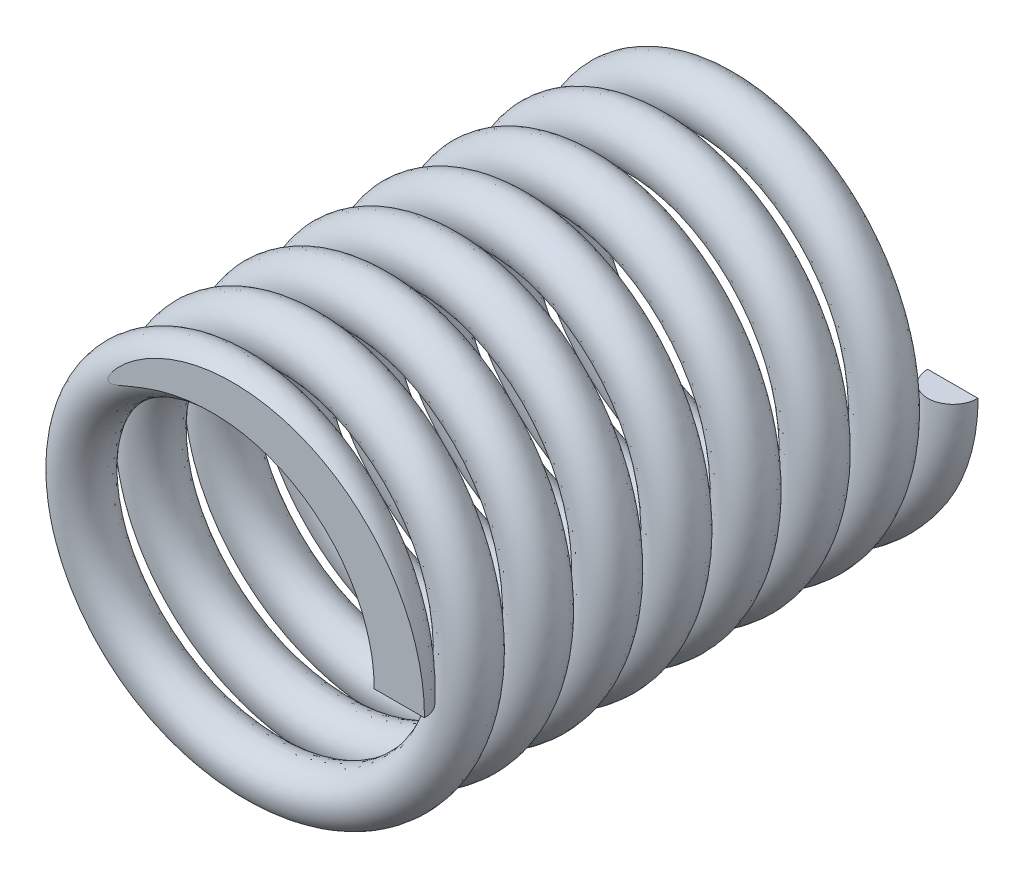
ISO-10303-21;
HEADER;
FILE_DESCRIPTION(('STEP AP214'),'2;1');
FILE_NAME('part.step','',(''),(''),'','','');
FILE_SCHEMA(('AUTOMOTIVE_DESIGN { 1 0 10303 214 1 1 1 1 }'));
ENDSEC;
DATA;
#1=APPLICATION_CONTEXT('core data for automotive mechanical design processes');
#2=APPLICATION_PROTOCOL_DEFINITION('international standard','automotive_design',2000,#1);
#3=PRODUCT_CONTEXT('',#1,'mechanical');
#4=PRODUCT('Part','Part','',(#3));
#5=PRODUCT_RELATED_PRODUCT_CATEGORY('part','',(#4));
#6=PRODUCT_DEFINITION_FORMATION('','',#4);
#7=PRODUCT_DEFINITION_CONTEXT('part definition',#1,'design');
#8=PRODUCT_DEFINITION('design','',#6,#7);
#9=PRODUCT_DEFINITION_SHAPE('','',#8);
#10=(LENGTH_UNIT() NAMED_UNIT(*) SI_UNIT(.MILLI.,.METRE.));
#11=(NAMED_UNIT(*) PLANE_ANGLE_UNIT() SI_UNIT($,.RADIAN.));
#12=(NAMED_UNIT(*) SI_UNIT($,.STERADIAN.) SOLID_ANGLE_UNIT());
#13=UNCERTAINTY_MEASURE_WITH_UNIT(LENGTH_MEASURE(1.E-05),#10,'distance_accuracy_value','');
#14=(GEOMETRIC_REPRESENTATION_CONTEXT(3) GLOBAL_UNCERTAINTY_ASSIGNED_CONTEXT((#13)) GLOBAL_UNIT_ASSIGNED_CONTEXT((#10,
#11,#12)) REPRESENTATION_CONTEXT('',''));
#15=CARTESIAN_POINT('',(0.,0.,0.));
#16=DIRECTION('',(0.,0.,1.));
#17=DIRECTION('',(1.,0.,0.));
#18=AXIS2_PLACEMENT_3D('',#15,#16,#17);
#19=CARTESIAN_POINT('',(3.5,0.,10.5));
#20=DIRECTION('',(0.,-1.,0.));
#21=DIRECTION('',(0.,0.,-1.));
#22=AXIS2_PLACEMENT_3D('',#19,#20,#21);
#23=PLANE('',#22);
#24=CARTESIAN_POINT('',(3.5,0.,11.));
#25=DIRECTION('',(0.,-1.,0.));
#26=DIRECTION('',(0.,0.,1.));
#27=AXIS2_PLACEMENT_3D('',#24,#25,#26);
#28=CIRCLE('',#27,0.500000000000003);
#29=CARTESIAN_POINT('',(3.,0.,11.));
#30=VERTEX_POINT('',#29);
#31=CARTESIAN_POINT('',(4.,0.,11.));
#32=VERTEX_POINT('',#31);
#33=EDGE_CURVE('E84',#30,#32,#28,.T.);
#34=ORIENTED_EDGE('',*,*,#33,.T.);
#35=DIRECTION('',(-1.,0.,0.));
#36=VECTOR('',#35,1.);
#37=CARTESIAN_POINT('',(3.5,0.,11.));
#38=LINE('',#37,#36);
#39=EDGE_CURVE('E67',#32,#30,#38,.T.);
#40=ORIENTED_EDGE('',*,*,#39,.T.);
#41=EDGE_LOOP('',(#34,#40));
#42=FACE_BOUND('',#41,.T.);
#43=ADVANCED_FACE('F49',(#42),#23,.T.);
#44=CARTESIAN_POINT('',(3.5,0.,0.500000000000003));
#45=CARTESIAN_POINT('',(3.5,-1.44974746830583,0.585937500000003));
#46=CARTESIAN_POINT('',(2.47487373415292,-2.47487373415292,0.671875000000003));
#47=CARTESIAN_POINT('',(1.44974746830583,-3.5,0.757812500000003));
#48=CARTESIAN_POINT('',(0.,-3.5,0.843750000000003));
#49=CARTESIAN_POINT('',(-1.44974746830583,-3.5,0.929687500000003));
#50=CARTESIAN_POINT('',(-2.47487373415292,-2.47487373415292,1.015625));
#51=CARTESIAN_POINT('',(-3.5,-1.44974746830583,1.1015625));
#52=CARTESIAN_POINT('',(-3.5,0.,1.1875));
#53=CARTESIAN_POINT('',(-3.5,1.44974746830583,1.2734375));
#54=CARTESIAN_POINT('',(-2.47487373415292,2.47487373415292,1.359375));
#55=CARTESIAN_POINT('',(-1.44974746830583,3.5,1.4453125));
#56=CARTESIAN_POINT('',(0.,3.5,1.53125));
#57=CARTESIAN_POINT('',(1.44974746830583,3.5,1.6171875));
#58=CARTESIAN_POINT('',(2.47487373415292,2.47487373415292,1.703125));
#59=CARTESIAN_POINT('',(3.5,1.44974746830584,1.7890625));
#60=CARTESIAN_POINT('',(3.5,0.,1.875));
#61=CARTESIAN_POINT('',(3.5,-1.44974746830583,1.9609375));
#62=CARTESIAN_POINT('',(2.47487373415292,-2.47487373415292,2.046875));
#63=CARTESIAN_POINT('',(1.44974746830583,-3.5,2.1328125));
#64=CARTESIAN_POINT('',(0.,-3.5,2.21875));
#65=CARTESIAN_POINT('',(-1.44974746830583,-3.5,2.3046875));
#66=CARTESIAN_POINT('',(-2.47487373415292,-2.47487373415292,2.390625));
#67=CARTESIAN_POINT('',(-3.5,-1.44974746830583,2.4765625));
#68=CARTESIAN_POINT('',(-3.5,0.,2.5625));
#69=CARTESIAN_POINT('',(-3.5,1.44974746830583,2.6484375));
#70=CARTESIAN_POINT('',(-2.47487373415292,2.47487373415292,2.734375));
#71=CARTESIAN_POINT('',(-1.44974746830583,3.5,2.8203125));
#72=CARTESIAN_POINT('',(0.,3.5,2.90625));
#73=CARTESIAN_POINT('',(1.44974746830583,3.5,2.9921875));
#74=CARTESIAN_POINT('',(2.47487373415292,2.47487373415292,3.078125));
#75=CARTESIAN_POINT('',(3.5,1.44974746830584,3.1640625));
#76=CARTESIAN_POINT('',(3.5,0.,3.25));
#77=CARTESIAN_POINT('',(3.5,-1.44974746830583,3.3359375));
#78=CARTESIAN_POINT('',(2.47487373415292,-2.47487373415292,3.421875));
#79=CARTESIAN_POINT('',(1.44974746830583,-3.5,3.5078125));
#80=CARTESIAN_POINT('',(0.,-3.5,3.59375));
#81=CARTESIAN_POINT('',(-1.44974746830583,-3.5,3.6796875));
#82=CARTESIAN_POINT('',(-2.47487373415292,-2.47487373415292,3.765625));
#83=CARTESIAN_POINT('',(-3.5,-1.44974746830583,3.8515625));
#84=CARTESIAN_POINT('',(-3.5,0.,3.9375));
#85=CARTESIAN_POINT('',(-3.5,1.44974746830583,4.0234375));
#86=CARTESIAN_POINT('',(-2.47487373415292,2.47487373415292,4.109375));
#87=CARTESIAN_POINT('',(-1.44974746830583,3.5,4.1953125));
#88=CARTESIAN_POINT('',(0.,3.5,4.28125));
#89=CARTESIAN_POINT('',(1.44974746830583,3.5,4.3671875));
#90=CARTESIAN_POINT('',(2.47487373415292,2.47487373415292,4.453125));
#91=CARTESIAN_POINT('',(3.5,1.44974746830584,4.5390625));
#92=CARTESIAN_POINT('',(3.5,0.,4.625));
#93=CARTESIAN_POINT('',(3.5,-1.44974746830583,4.7109375));
#94=CARTESIAN_POINT('',(2.47487373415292,-2.47487373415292,4.796875));
#95=CARTESIAN_POINT('',(1.44974746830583,-3.5,4.8828125));
#96=CARTESIAN_POINT('',(0.,-3.5,4.96875));
#97=CARTESIAN_POINT('',(-1.44974746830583,-3.5,5.0546875));
#98=CARTESIAN_POINT('',(-2.47487373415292,-2.47487373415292,5.140625));
#99=CARTESIAN_POINT('',(-3.5,-1.44974746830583,5.2265625));
#100=CARTESIAN_POINT('',(-3.5,0.,5.3125));
#101=CARTESIAN_POINT('',(-3.5,1.44974746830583,5.3984375));
#102=CARTESIAN_POINT('',(-2.47487373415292,2.47487373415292,5.484375));
#103=CARTESIAN_POINT('',(-1.44974746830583,3.5,5.5703125));
#104=CARTESIAN_POINT('',(0.,3.5,5.65625));
#105=CARTESIAN_POINT('',(1.44974746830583,3.5,5.7421875));
#106=CARTESIAN_POINT('',(2.47487373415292,2.47487373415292,5.828125));
#107=CARTESIAN_POINT('',(3.5,1.44974746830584,5.9140625));
#108=CARTESIAN_POINT('',(3.5,0.,6.));
#109=CARTESIAN_POINT('',(3.5,-1.44974746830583,6.0859375));
#110=CARTESIAN_POINT('',(2.47487373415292,-2.47487373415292,6.171875));
#111=CARTESIAN_POINT('',(1.44974746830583,-3.5,6.2578125));
#112=CARTESIAN_POINT('',(0.,-3.5,6.34375));
#113=CARTESIAN_POINT('',(-1.44974746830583,-3.5,6.4296875));
#114=CARTESIAN_POINT('',(-2.47487373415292,-2.47487373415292,6.515625));
#115=CARTESIAN_POINT('',(-3.5,-1.44974746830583,6.6015625));
#116=CARTESIAN_POINT('',(-3.5,0.,6.6875));
#117=CARTESIAN_POINT('',(-3.5,1.44974746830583,6.7734375));
#118=CARTESIAN_POINT('',(-2.47487373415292,2.47487373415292,6.859375));
#119=CARTESIAN_POINT('',(-1.44974746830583,3.5,6.9453125));
#120=CARTESIAN_POINT('',(0.,3.5,7.03125));
#121=CARTESIAN_POINT('',(1.44974746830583,3.5,7.1171875));
#122=CARTESIAN_POINT('',(2.47487373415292,2.47487373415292,7.203125));
#123=CARTESIAN_POINT('',(3.5,1.44974746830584,7.2890625));
#124=CARTESIAN_POINT('',(3.5,0.,7.375));
#125=CARTESIAN_POINT('',(3.5,-1.44974746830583,7.4609375));
#126=CARTESIAN_POINT('',(2.47487373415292,-2.47487373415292,7.546875));
#127=CARTESIAN_POINT('',(1.44974746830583,-3.5,7.6328125));
#128=CARTESIAN_POINT('',(0.,-3.5,7.71875));
#129=CARTESIAN_POINT('',(-1.44974746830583,-3.5,7.8046875));
#130=CARTESIAN_POINT('',(-2.47487373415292,-2.47487373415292,7.890625));
#131=CARTESIAN_POINT('',(-3.5,-1.44974746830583,7.9765625));
#132=CARTESIAN_POINT('',(-3.5,0.,8.0625));
#133=CARTESIAN_POINT('',(-3.5,1.44974746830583,8.1484375));
#134=CARTESIAN_POINT('',(-2.47487373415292,2.47487373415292,8.234375));
#135=CARTESIAN_POINT('',(-1.44974746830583,3.5,8.3203125));
#136=CARTESIAN_POINT('',(0.,3.5,8.40625));
#137=CARTESIAN_POINT('',(1.44974746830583,3.5,8.4921875));
#138=CARTESIAN_POINT('',(2.47487373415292,2.47487373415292,8.578125));
#139=CARTESIAN_POINT('',(3.5,1.44974746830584,8.6640625));
#140=CARTESIAN_POINT('',(3.5,0.,8.75));
#141=CARTESIAN_POINT('',(3.5,-1.44974746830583,8.8359375));
#142=CARTESIAN_POINT('',(2.47487373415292,-2.47487373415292,8.921875));
#143=CARTESIAN_POINT('',(1.44974746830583,-3.5,9.0078125));
#144=CARTESIAN_POINT('',(0.,-3.5,9.09375));
#145=CARTESIAN_POINT('',(-1.44974746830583,-3.5,9.1796875));
#146=CARTESIAN_POINT('',(-2.47487373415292,-2.47487373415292,9.265625));
#147=CARTESIAN_POINT('',(-3.5,-1.44974746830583,9.3515625));
#148=CARTESIAN_POINT('',(-3.5,0.,9.4375));
#149=CARTESIAN_POINT('',(-3.5,1.44974746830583,9.5234375));
#150=CARTESIAN_POINT('',(-2.47487373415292,2.47487373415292,9.609375));
#151=CARTESIAN_POINT('',(-1.44974746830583,3.5,9.6953125));
#152=CARTESIAN_POINT('',(0.,3.5,9.78125));
#153=CARTESIAN_POINT('',(1.44974746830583,3.5,9.8671875));
#154=CARTESIAN_POINT('',(2.47487373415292,2.47487373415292,9.953125));
#155=CARTESIAN_POINT('',(3.5,1.44974746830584,10.0390625));
#156=CARTESIAN_POINT('',(3.5,0.,10.125));
#157=CARTESIAN_POINT('',(3.5,-1.44974746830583,10.2109375));
#158=CARTESIAN_POINT('',(2.47487373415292,-2.47487373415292,10.296875));
#159=CARTESIAN_POINT('',(1.44974746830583,-3.5,10.3828125));
#160=CARTESIAN_POINT('',(0.,-3.5,10.46875));
#161=CARTESIAN_POINT('',(-1.44974746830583,-3.5,10.5546875));
#162=CARTESIAN_POINT('',(-2.47487373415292,-2.47487373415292,10.640625));
#163=CARTESIAN_POINT('',(-3.5,-1.44974746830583,10.7265625));
#164=CARTESIAN_POINT('',(-3.5,0.,10.8125));
#165=CARTESIAN_POINT('',(-3.5,1.44974746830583,10.8984375));
#166=CARTESIAN_POINT('',(-2.47487373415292,2.47487373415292,10.984375));
#167=CARTESIAN_POINT('',(-1.44974746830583,3.5,11.0703125));
#168=CARTESIAN_POINT('',(0.,3.5,11.15625));
#169=CARTESIAN_POINT('',(1.44974746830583,3.5,11.2421875));
#170=CARTESIAN_POINT('',(2.47487373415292,2.47487373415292,11.328125));
#171=CARTESIAN_POINT('',(3.5,1.44974746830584,11.4140625));
#172=CARTESIAN_POINT('',(3.5,0.,11.5));
#173=CARTESIAN_POINT('',(3.63079159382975,0.,0.500000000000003));
#174=CARTESIAN_POINT('',(3.63079159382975,-1.50392312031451,0.585937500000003));
#175=CARTESIAN_POINT('',(2.56735735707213,-2.56735735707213,0.671875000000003));
#176=CARTESIAN_POINT('',(1.50392312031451,-3.63079159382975,0.757812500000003));
#177=CARTESIAN_POINT('',(0.,-3.63079159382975,0.843750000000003));
#178=CARTESIAN_POINT('',(-1.50392312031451,-3.63079159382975,0.929687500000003));
#179=CARTESIAN_POINT('',(-2.56735735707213,-2.56735735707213,1.015625));
#180=CARTESIAN_POINT('',(-3.63079159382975,-1.50392312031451,1.1015625));
#181=CARTESIAN_POINT('',(-3.63079159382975,0.,1.1875));
#182=CARTESIAN_POINT('',(-3.63079159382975,1.50392312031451,1.2734375));
#183=CARTESIAN_POINT('',(-2.56735735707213,2.56735735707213,1.359375));
#184=CARTESIAN_POINT('',(-1.50392312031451,3.63079159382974,1.4453125));
#185=CARTESIAN_POINT('',(0.,3.63079159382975,1.53125));
#186=CARTESIAN_POINT('',(1.50392312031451,3.63079159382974,1.6171875));
#187=CARTESIAN_POINT('',(2.56735735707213,2.56735735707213,1.703125));
#188=CARTESIAN_POINT('',(3.63079159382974,1.50392312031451,1.7890625));
#189=CARTESIAN_POINT('',(3.63079159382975,0.,1.875));
#190=CARTESIAN_POINT('',(3.63079159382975,-1.50392312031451,1.9609375));
#191=CARTESIAN_POINT('',(2.56735735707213,-2.56735735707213,2.046875));
#192=CARTESIAN_POINT('',(1.50392312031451,-3.63079159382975,2.1328125));
#193=CARTESIAN_POINT('',(0.,-3.63079159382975,2.21875));
#194=CARTESIAN_POINT('',(-1.50392312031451,-3.63079159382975,2.3046875));
#195=CARTESIAN_POINT('',(-2.56735735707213,-2.56735735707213,2.390625));
#196=CARTESIAN_POINT('',(-3.63079159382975,-1.50392312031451,2.4765625));
#197=CARTESIAN_POINT('',(-3.63079159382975,0.,2.5625));
#198=CARTESIAN_POINT('',(-3.63079159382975,1.50392312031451,2.6484375));
#199=CARTESIAN_POINT('',(-2.56735735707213,2.56735735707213,2.734375));
#200=CARTESIAN_POINT('',(-1.50392312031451,3.63079159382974,2.8203125));
#201=CARTESIAN_POINT('',(0.,3.63079159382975,2.90625));
#202=CARTESIAN_POINT('',(1.50392312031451,3.63079159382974,2.9921875));
#203=CARTESIAN_POINT('',(2.56735735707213,2.56735735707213,3.078125));
#204=CARTESIAN_POINT('',(3.63079159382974,1.50392312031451,3.1640625));
#205=CARTESIAN_POINT('',(3.63079159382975,0.,3.25));
#206=CARTESIAN_POINT('',(3.63079159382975,-1.50392312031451,3.3359375));
#207=CARTESIAN_POINT('',(2.56735735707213,-2.56735735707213,3.421875));
#208=CARTESIAN_POINT('',(1.50392312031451,-3.63079159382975,3.5078125));
#209=CARTESIAN_POINT('',(0.,-3.63079159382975,3.59375));
#210=CARTESIAN_POINT('',(-1.50392312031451,-3.63079159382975,3.6796875));
#211=CARTESIAN_POINT('',(-2.56735735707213,-2.56735735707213,3.765625));
#212=CARTESIAN_POINT('',(-3.63079159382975,-1.50392312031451,3.8515625));
#213=CARTESIAN_POINT('',(-3.63079159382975,0.,3.9375));
#214=CARTESIAN_POINT('',(-3.63079159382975,1.50392312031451,4.0234375));
#215=CARTESIAN_POINT('',(-2.56735735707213,2.56735735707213,4.109375));
#216=CARTESIAN_POINT('',(-1.50392312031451,3.63079159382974,4.1953125));
#217=CARTESIAN_POINT('',(0.,3.63079159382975,4.28125));
#218=CARTESIAN_POINT('',(1.50392312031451,3.63079159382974,4.3671875));
#219=CARTESIAN_POINT('',(2.56735735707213,2.56735735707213,4.453125));
#220=CARTESIAN_POINT('',(3.63079159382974,1.50392312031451,4.5390625));
#221=CARTESIAN_POINT('',(3.63079159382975,0.,4.625));
#222=CARTESIAN_POINT('',(3.63079159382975,-1.50392312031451,4.7109375));
#223=CARTESIAN_POINT('',(2.56735735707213,-2.56735735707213,4.796875));
#224=CARTESIAN_POINT('',(1.50392312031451,-3.63079159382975,4.8828125));
#225=CARTESIAN_POINT('',(0.,-3.63079159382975,4.96875));
#226=CARTESIAN_POINT('',(-1.50392312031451,-3.63079159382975,5.0546875));
#227=CARTESIAN_POINT('',(-2.56735735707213,-2.56735735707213,5.140625));
#228=CARTESIAN_POINT('',(-3.63079159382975,-1.50392312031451,5.2265625));
#229=CARTESIAN_POINT('',(-3.63079159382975,0.,5.3125));
#230=CARTESIAN_POINT('',(-3.63079159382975,1.50392312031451,5.3984375));
#231=CARTESIAN_POINT('',(-2.56735735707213,2.56735735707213,5.484375));
#232=CARTESIAN_POINT('',(-1.50392312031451,3.63079159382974,5.5703125));
#233=CARTESIAN_POINT('',(0.,3.63079159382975,5.65625));
#234=CARTESIAN_POINT('',(1.50392312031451,3.63079159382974,5.7421875));
#235=CARTESIAN_POINT('',(2.56735735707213,2.56735735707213,5.828125));
#236=CARTESIAN_POINT('',(3.63079159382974,1.50392312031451,5.9140625));
#237=CARTESIAN_POINT('',(3.63079159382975,0.,6.));
#238=CARTESIAN_POINT('',(3.63079159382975,-1.50392312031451,6.0859375));
#239=CARTESIAN_POINT('',(2.56735735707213,-2.56735735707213,6.171875));
#240=CARTESIAN_POINT('',(1.50392312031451,-3.63079159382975,6.2578125));
#241=CARTESIAN_POINT('',(0.,-3.63079159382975,6.34375));
#242=CARTESIAN_POINT('',(-1.50392312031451,-3.63079159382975,6.4296875));
#243=CARTESIAN_POINT('',(-2.56735735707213,-2.56735735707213,6.515625));
#244=CARTESIAN_POINT('',(-3.63079159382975,-1.50392312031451,6.6015625));
#245=CARTESIAN_POINT('',(-3.63079159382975,0.,6.6875));
#246=CARTESIAN_POINT('',(-3.63079159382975,1.50392312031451,6.7734375));
#247=CARTESIAN_POINT('',(-2.56735735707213,2.56735735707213,6.859375));
#248=CARTESIAN_POINT('',(-1.50392312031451,3.63079159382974,6.9453125));
#249=CARTESIAN_POINT('',(0.,3.63079159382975,7.03125));
#250=CARTESIAN_POINT('',(1.50392312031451,3.63079159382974,7.1171875));
#251=CARTESIAN_POINT('',(2.56735735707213,2.56735735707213,7.203125));
#252=CARTESIAN_POINT('',(3.63079159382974,1.50392312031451,7.2890625));
#253=CARTESIAN_POINT('',(3.63079159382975,0.,7.375));
#254=CARTESIAN_POINT('',(3.63079159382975,-1.50392312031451,7.4609375));
#255=CARTESIAN_POINT('',(2.56735735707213,-2.56735735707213,7.546875));
#256=CARTESIAN_POINT('',(1.50392312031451,-3.63079159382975,7.6328125));
#257=CARTESIAN_POINT('',(0.,-3.63079159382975,7.71875));
#258=CARTESIAN_POINT('',(-1.50392312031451,-3.63079159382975,7.8046875));
#259=CARTESIAN_POINT('',(-2.56735735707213,-2.56735735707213,7.890625));
#260=CARTESIAN_POINT('',(-3.63079159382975,-1.50392312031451,7.9765625));
#261=CARTESIAN_POINT('',(-3.63079159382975,0.,8.0625));
#262=CARTESIAN_POINT('',(-3.63079159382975,1.50392312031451,8.1484375));
#263=CARTESIAN_POINT('',(-2.56735735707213,2.56735735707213,8.234375));
#264=CARTESIAN_POINT('',(-1.50392312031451,3.63079159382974,8.3203125));
#265=CARTESIAN_POINT('',(0.,3.63079159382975,8.40625));
#266=CARTESIAN_POINT('',(1.50392312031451,3.63079159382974,8.4921875));
#267=CARTESIAN_POINT('',(2.56735735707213,2.56735735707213,8.578125));
#268=CARTESIAN_POINT('',(3.63079159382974,1.50392312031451,8.6640625));
#269=CARTESIAN_POINT('',(3.63079159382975,0.,8.75));
#270=CARTESIAN_POINT('',(3.63079159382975,-1.50392312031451,8.8359375));
#271=CARTESIAN_POINT('',(2.56735735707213,-2.56735735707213,8.921875));
#272=CARTESIAN_POINT('',(1.50392312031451,-3.63079159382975,9.0078125));
#273=CARTESIAN_POINT('',(0.,-3.63079159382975,9.09375));
#274=CARTESIAN_POINT('',(-1.50392312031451,-3.63079159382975,9.1796875));
#275=CARTESIAN_POINT('',(-2.56735735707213,-2.56735735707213,9.265625));
#276=CARTESIAN_POINT('',(-3.63079159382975,-1.50392312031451,9.3515625));
#277=CARTESIAN_POINT('',(-3.63079159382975,0.,9.4375));
#278=CARTESIAN_POINT('',(-3.63079159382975,1.50392312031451,9.5234375));
#279=CARTESIAN_POINT('',(-2.56735735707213,2.56735735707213,9.609375));
#280=CARTESIAN_POINT('',(-1.50392312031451,3.63079159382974,9.6953125));
#281=CARTESIAN_POINT('',(0.,3.63079159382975,9.78125));
#282=CARTESIAN_POINT('',(1.50392312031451,3.63079159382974,9.8671875));
#283=CARTESIAN_POINT('',(2.56735735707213,2.56735735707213,9.953125));
#284=CARTESIAN_POINT('',(3.63079159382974,1.50392312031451,10.0390625));
#285=CARTESIAN_POINT('',(3.63079159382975,0.,10.125));
#286=CARTESIAN_POINT('',(3.63079159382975,-1.50392312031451,10.2109375));
#287=CARTESIAN_POINT('',(2.56735735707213,-2.56735735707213,10.296875));
#288=CARTESIAN_POINT('',(1.50392312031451,-3.63079159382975,10.3828125));
#289=CARTESIAN_POINT('',(0.,-3.63079159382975,10.46875));
#290=CARTESIAN_POINT('',(-1.50392312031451,-3.63079159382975,10.5546875));
#291=CARTESIAN_POINT('',(-2.56735735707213,-2.56735735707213,10.640625));
#292=CARTESIAN_POINT('',(-3.63079159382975,-1.50392312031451,10.7265625));
#293=CARTESIAN_POINT('',(-3.63079159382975,0.,10.8125));
#294=CARTESIAN_POINT('',(-3.63079159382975,1.50392312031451,10.8984375));
#295=CARTESIAN_POINT('',(-2.56735735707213,2.56735735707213,10.984375));
#296=CARTESIAN_POINT('',(-1.50392312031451,3.63079159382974,11.0703125));
#297=CARTESIAN_POINT('',(0.,3.63079159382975,11.15625));
#298=CARTESIAN_POINT('',(1.50392312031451,3.63079159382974,11.2421875));
#299=CARTESIAN_POINT('',(2.56735735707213,2.56735735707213,11.328125));
#300=CARTESIAN_POINT('',(3.63079159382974,1.50392312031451,11.4140625));
#301=CARTESIAN_POINT('',(3.63079159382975,0.,11.5));
#302=CARTESIAN_POINT('',(4.,0.,0.424763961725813));
#303=CARTESIAN_POINT('',(4.,-1.65685424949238,0.510701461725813));
#304=CARTESIAN_POINT('',(2.82842712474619,-2.82842712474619,0.596638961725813));
#305=CARTESIAN_POINT('',(1.65685424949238,-4.,0.682576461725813));
#306=CARTESIAN_POINT('',(0.,-4.,0.768513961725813));
#307=CARTESIAN_POINT('',(-1.65685424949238,-4.,0.854451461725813));
#308=CARTESIAN_POINT('',(-2.82842712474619,-2.82842712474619,0.940388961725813));
#309=CARTESIAN_POINT('',(-4.,-1.65685424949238,1.02632646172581));
#310=CARTESIAN_POINT('',(-4.,0.,1.11226396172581));
#311=CARTESIAN_POINT('',(-4.,1.65685424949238,1.19820146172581));
#312=CARTESIAN_POINT('',(-2.82842712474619,2.82842712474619,1.28413896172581));
#313=CARTESIAN_POINT('',(-1.65685424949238,4.,1.37007646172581));
#314=CARTESIAN_POINT('',(0.,4.,1.45601396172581));
#315=CARTESIAN_POINT('',(1.65685424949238,4.,1.54195146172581));
#316=CARTESIAN_POINT('',(2.82842712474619,2.82842712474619,1.62788896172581));
#317=CARTESIAN_POINT('',(4.,1.65685424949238,1.71382646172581));
#318=CARTESIAN_POINT('',(4.,0.,1.79976396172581));
#319=CARTESIAN_POINT('',(4.,-1.65685424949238,1.88570146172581));
#320=CARTESIAN_POINT('',(2.82842712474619,-2.82842712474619,1.97163896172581));
#321=CARTESIAN_POINT('',(1.65685424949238,-4.,2.05757646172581));
#322=CARTESIAN_POINT('',(0.,-4.,2.14351396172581));
#323=CARTESIAN_POINT('',(-1.65685424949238,-4.,2.22945146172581));
#324=CARTESIAN_POINT('',(-2.82842712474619,-2.82842712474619,2.31538896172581));
#325=CARTESIAN_POINT('',(-4.,-1.65685424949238,2.40132646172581));
#326=CARTESIAN_POINT('',(-4.,0.,2.48726396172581));
#327=CARTESIAN_POINT('',(-4.,1.65685424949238,2.57320146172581));
#328=CARTESIAN_POINT('',(-2.82842712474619,2.82842712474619,2.65913896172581));
#329=CARTESIAN_POINT('',(-1.65685424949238,4.,2.74507646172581));
#330=CARTESIAN_POINT('',(0.,4.,2.83101396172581));
#331=CARTESIAN_POINT('',(1.65685424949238,4.,2.91695146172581));
#332=CARTESIAN_POINT('',(2.82842712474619,2.82842712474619,3.00288896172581));
#333=CARTESIAN_POINT('',(4.,1.65685424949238,3.08882646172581));
#334=CARTESIAN_POINT('',(4.,0.,3.17476396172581));
#335=CARTESIAN_POINT('',(4.,-1.65685424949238,3.26070146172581));
#336=CARTESIAN_POINT('',(2.82842712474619,-2.82842712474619,3.34663896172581));
#337=CARTESIAN_POINT('',(1.65685424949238,-4.,3.43257646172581));
#338=CARTESIAN_POINT('',(0.,-4.,3.51851396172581));
#339=CARTESIAN_POINT('',(-1.65685424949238,-4.,3.60445146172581));
#340=CARTESIAN_POINT('',(-2.82842712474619,-2.82842712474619,3.69038896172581));
#341=CARTESIAN_POINT('',(-4.,-1.65685424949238,3.77632646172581));
#342=CARTESIAN_POINT('',(-4.,0.,3.86226396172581));
#343=CARTESIAN_POINT('',(-4.,1.65685424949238,3.94820146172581));
#344=CARTESIAN_POINT('',(-2.82842712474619,2.82842712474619,4.03413896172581));
#345=CARTESIAN_POINT('',(-1.65685424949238,4.,4.12007646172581));
#346=CARTESIAN_POINT('',(0.,4.,4.20601396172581));
#347=CARTESIAN_POINT('',(1.65685424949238,4.,4.29195146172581));
#348=CARTESIAN_POINT('',(2.82842712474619,2.82842712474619,4.37788896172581));
#349=CARTESIAN_POINT('',(4.,1.65685424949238,4.46382646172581));
#350=CARTESIAN_POINT('',(4.,0.,4.54976396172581));
#351=CARTESIAN_POINT('',(4.,-1.65685424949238,4.63570146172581));
#352=CARTESIAN_POINT('',(2.82842712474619,-2.82842712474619,4.72163896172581));
#353=CARTESIAN_POINT('',(1.65685424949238,-4.,4.80757646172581));
#354=CARTESIAN_POINT('',(0.,-4.,4.89351396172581));
#355=CARTESIAN_POINT('',(-1.65685424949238,-4.,4.97945146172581));
#356=CARTESIAN_POINT('',(-2.82842712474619,-2.82842712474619,5.06538896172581));
#357=CARTESIAN_POINT('',(-4.,-1.65685424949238,5.15132646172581));
#358=CARTESIAN_POINT('',(-4.,0.,5.23726396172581));
#359=CARTESIAN_POINT('',(-4.,1.65685424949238,5.32320146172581));
#360=CARTESIAN_POINT('',(-2.82842712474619,2.82842712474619,5.40913896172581));
#361=CARTESIAN_POINT('',(-1.65685424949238,4.,5.49507646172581));
#362=CARTESIAN_POINT('',(0.,4.,5.58101396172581));
#363=CARTESIAN_POINT('',(1.65685424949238,4.,5.66695146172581));
#364=CARTESIAN_POINT('',(2.82842712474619,2.82842712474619,5.75288896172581));
#365=CARTESIAN_POINT('',(4.,1.65685424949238,5.83882646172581));
#366=CARTESIAN_POINT('',(4.,0.,5.92476396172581));
#367=CARTESIAN_POINT('',(4.,-1.65685424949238,6.01070146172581));
#368=CARTESIAN_POINT('',(2.82842712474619,-2.82842712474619,6.09663896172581));
#369=CARTESIAN_POINT('',(1.65685424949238,-4.,6.18257646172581));
#370=CARTESIAN_POINT('',(0.,-4.,6.26851396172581));
#371=CARTESIAN_POINT('',(-1.65685424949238,-4.,6.35445146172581));
#372=CARTESIAN_POINT('',(-2.82842712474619,-2.82842712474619,6.44038896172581));
#373=CARTESIAN_POINT('',(-4.,-1.65685424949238,6.52632646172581));
#374=CARTESIAN_POINT('',(-4.,0.,6.61226396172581));
#375=CARTESIAN_POINT('',(-4.,1.65685424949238,6.69820146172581));
#376=CARTESIAN_POINT('',(-2.82842712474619,2.82842712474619,6.78413896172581));
#377=CARTESIAN_POINT('',(-1.65685424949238,4.,6.87007646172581));
#378=CARTESIAN_POINT('',(0.,4.,6.95601396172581));
#379=CARTESIAN_POINT('',(1.65685424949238,4.,7.04195146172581));
#380=CARTESIAN_POINT('',(2.82842712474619,2.82842712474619,7.12788896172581));
#381=CARTESIAN_POINT('',(4.,1.65685424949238,7.21382646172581));
#382=CARTESIAN_POINT('',(4.,0.,7.29976396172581));
#383=CARTESIAN_POINT('',(4.,-1.65685424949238,7.38570146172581));
#384=CARTESIAN_POINT('',(2.82842712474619,-2.82842712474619,7.47163896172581));
#385=CARTESIAN_POINT('',(1.65685424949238,-4.,7.55757646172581));
#386=CARTESIAN_POINT('',(0.,-4.,7.64351396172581));
#387=CARTESIAN_POINT('',(-1.65685424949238,-4.,7.72945146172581));
#388=CARTESIAN_POINT('',(-2.82842712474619,-2.82842712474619,7.81538896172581));
#389=CARTESIAN_POINT('',(-4.,-1.65685424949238,7.90132646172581));
#390=CARTESIAN_POINT('',(-4.,0.,7.98726396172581));
#391=CARTESIAN_POINT('',(-4.,1.65685424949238,8.07320146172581));
#392=CARTESIAN_POINT('',(-2.82842712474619,2.82842712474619,8.15913896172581));
#393=CARTESIAN_POINT('',(-1.65685424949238,4.,8.24507646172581));
#394=CARTESIAN_POINT('',(0.,4.,8.33101396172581));
#395=CARTESIAN_POINT('',(1.65685424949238,4.,8.41695146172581));
#396=CARTESIAN_POINT('',(2.82842712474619,2.82842712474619,8.50288896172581));
#397=CARTESIAN_POINT('',(4.,1.65685424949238,8.58882646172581));
#398=CARTESIAN_POINT('',(4.,0.,8.67476396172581));
#399=CARTESIAN_POINT('',(4.,-1.65685424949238,8.76070146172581));
#400=CARTESIAN_POINT('',(2.82842712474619,-2.82842712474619,8.84663896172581));
#401=CARTESIAN_POINT('',(1.65685424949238,-4.,8.93257646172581));
#402=CARTESIAN_POINT('',(0.,-4.,9.01851396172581));
#403=CARTESIAN_POINT('',(-1.65685424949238,-4.,9.10445146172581));
#404=CARTESIAN_POINT('',(-2.82842712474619,-2.82842712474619,9.19038896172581));
#405=CARTESIAN_POINT('',(-4.,-1.65685424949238,9.27632646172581));
#406=CARTESIAN_POINT('',(-4.,0.,9.36226396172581));
#407=CARTESIAN_POINT('',(-4.,1.65685424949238,9.44820146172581));
#408=CARTESIAN_POINT('',(-2.82842712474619,2.82842712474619,9.53413896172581));
#409=CARTESIAN_POINT('',(-1.65685424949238,4.,9.62007646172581));
#410=CARTESIAN_POINT('',(0.,4.,9.70601396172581));
#411=CARTESIAN_POINT('',(1.65685424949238,4.,9.79195146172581));
#412=CARTESIAN_POINT('',(2.82842712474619,2.82842712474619,9.87788896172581));
#413=CARTESIAN_POINT('',(4.,1.65685424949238,9.96382646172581));
#414=CARTESIAN_POINT('',(4.,0.,10.0497639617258));
#415=CARTESIAN_POINT('',(4.,-1.65685424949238,10.1357014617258));
#416=CARTESIAN_POINT('',(2.82842712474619,-2.82842712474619,10.2216389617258));
#417=CARTESIAN_POINT('',(1.65685424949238,-4.,10.3075764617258));
#418=CARTESIAN_POINT('',(0.,-4.,10.3935139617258));
#419=CARTESIAN_POINT('',(-1.65685424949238,-4.,10.4794514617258));
#420=CARTESIAN_POINT('',(-2.82842712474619,-2.82842712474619,10.5653889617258));
#421=CARTESIAN_POINT('',(-4.,-1.65685424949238,10.6513264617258));
#422=CARTESIAN_POINT('',(-4.,0.,10.7372639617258));
#423=CARTESIAN_POINT('',(-4.,1.65685424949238,10.8232014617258));
#424=CARTESIAN_POINT('',(-2.82842712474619,2.82842712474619,10.9091389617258));
#425=CARTESIAN_POINT('',(-1.65685424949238,4.,10.9950764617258));
#426=CARTESIAN_POINT('',(0.,4.,11.0810139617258));
#427=CARTESIAN_POINT('',(1.65685424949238,4.,11.1669514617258));
#428=CARTESIAN_POINT('',(2.82842712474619,2.82842712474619,11.2528889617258));
#429=CARTESIAN_POINT('',(4.,1.65685424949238,11.3388264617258));
#430=CARTESIAN_POINT('',(4.,0.,11.4247639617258));
#431=CARTESIAN_POINT('',(4.,0.,-0.424763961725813));
#432=CARTESIAN_POINT('',(4.,-1.65685424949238,-0.338826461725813));
#433=CARTESIAN_POINT('',(2.82842712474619,-2.82842712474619,-0.252888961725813));
#434=CARTESIAN_POINT('',(1.65685424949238,-4.,-0.166951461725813));
#435=CARTESIAN_POINT('',(0.,-4.,-0.0810139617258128));
#436=CARTESIAN_POINT('',(-1.65685424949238,-4.,0.00492353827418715));
#437=CARTESIAN_POINT('',(-2.82842712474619,-2.82842712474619,0.0908610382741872));
#438=CARTESIAN_POINT('',(-4.,-1.65685424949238,0.176798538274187));
#439=CARTESIAN_POINT('',(-4.,0.,0.262736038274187));
#440=CARTESIAN_POINT('',(-4.,1.65685424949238,0.348673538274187));
#441=CARTESIAN_POINT('',(-2.82842712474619,2.82842712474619,0.434611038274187));
#442=CARTESIAN_POINT('',(-1.65685424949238,4.,0.520548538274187));
#443=CARTESIAN_POINT('',(0.,4.,0.606486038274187));
#444=CARTESIAN_POINT('',(1.65685424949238,4.,0.692423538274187));
#445=CARTESIAN_POINT('',(2.82842712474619,2.82842712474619,0.778361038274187));
#446=CARTESIAN_POINT('',(4.,1.65685424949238,0.864298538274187));
#447=CARTESIAN_POINT('',(4.,0.,0.950236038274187));
#448=CARTESIAN_POINT('',(4.,-1.65685424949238,1.03617353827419));
#449=CARTESIAN_POINT('',(2.82842712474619,-2.82842712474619,1.12211103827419));
#450=CARTESIAN_POINT('',(1.65685424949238,-4.,1.20804853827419));
#451=CARTESIAN_POINT('',(0.,-4.,1.29398603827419));
#452=CARTESIAN_POINT('',(-1.65685424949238,-4.,1.37992353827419));
#453=CARTESIAN_POINT('',(-2.82842712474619,-2.82842712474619,1.46586103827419));
#454=CARTESIAN_POINT('',(-4.,-1.65685424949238,1.55179853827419));
#455=CARTESIAN_POINT('',(-4.,0.,1.63773603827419));
#456=CARTESIAN_POINT('',(-4.,1.65685424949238,1.72367353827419));
#457=CARTESIAN_POINT('',(-2.82842712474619,2.82842712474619,1.80961103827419));
#458=CARTESIAN_POINT('',(-1.65685424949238,4.,1.89554853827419));
#459=CARTESIAN_POINT('',(0.,4.,1.98148603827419));
#460=CARTESIAN_POINT('',(1.65685424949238,4.,2.06742353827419));
#461=CARTESIAN_POINT('',(2.82842712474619,2.82842712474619,2.15336103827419));
#462=CARTESIAN_POINT('',(4.,1.65685424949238,2.23929853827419));
#463=CARTESIAN_POINT('',(4.,0.,2.32523603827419));
#464=CARTESIAN_POINT('',(4.,-1.65685424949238,2.41117353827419));
#465=CARTESIAN_POINT('',(2.82842712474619,-2.82842712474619,2.49711103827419));
#466=CARTESIAN_POINT('',(1.65685424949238,-4.,2.58304853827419));
#467=CARTESIAN_POINT('',(0.,-4.,2.66898603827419));
#468=CARTESIAN_POINT('',(-1.65685424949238,-4.,2.75492353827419));
#469=CARTESIAN_POINT('',(-2.82842712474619,-2.82842712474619,2.84086103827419));
#470=CARTESIAN_POINT('',(-4.,-1.65685424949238,2.92679853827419));
#471=CARTESIAN_POINT('',(-4.,0.,3.01273603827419));
#472=CARTESIAN_POINT('',(-4.,1.65685424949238,3.09867353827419));
#473=CARTESIAN_POINT('',(-2.82842712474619,2.82842712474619,3.18461103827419));
#474=CARTESIAN_POINT('',(-1.65685424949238,4.,3.27054853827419));
#475=CARTESIAN_POINT('',(0.,4.,3.35648603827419));
#476=CARTESIAN_POINT('',(1.65685424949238,4.,3.44242353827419));
#477=CARTESIAN_POINT('',(2.82842712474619,2.82842712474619,3.52836103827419));
#478=CARTESIAN_POINT('',(4.,1.65685424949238,3.61429853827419));
#479=CARTESIAN_POINT('',(4.,0.,3.70023603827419));
#480=CARTESIAN_POINT('',(4.,-1.65685424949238,3.78617353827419));
#481=CARTESIAN_POINT('',(2.82842712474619,-2.82842712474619,3.87211103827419));
#482=CARTESIAN_POINT('',(1.65685424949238,-4.,3.95804853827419));
#483=CARTESIAN_POINT('',(0.,-4.,4.04398603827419));
#484=CARTESIAN_POINT('',(-1.65685424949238,-4.,4.12992353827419));
#485=CARTESIAN_POINT('',(-2.82842712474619,-2.82842712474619,4.21586103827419));
#486=CARTESIAN_POINT('',(-4.,-1.65685424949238,4.30179853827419));
#487=CARTESIAN_POINT('',(-4.,0.,4.38773603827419));
#488=CARTESIAN_POINT('',(-4.,1.65685424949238,4.47367353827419));
#489=CARTESIAN_POINT('',(-2.82842712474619,2.82842712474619,4.55961103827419));
#490=CARTESIAN_POINT('',(-1.65685424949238,4.,4.64554853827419));
#491=CARTESIAN_POINT('',(0.,4.,4.73148603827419));
#492=CARTESIAN_POINT('',(1.65685424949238,4.,4.81742353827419));
#493=CARTESIAN_POINT('',(2.82842712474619,2.82842712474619,4.90336103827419));
#494=CARTESIAN_POINT('',(4.,1.65685424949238,4.98929853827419));
#495=CARTESIAN_POINT('',(4.,0.,5.07523603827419));
#496=CARTESIAN_POINT('',(4.,-1.65685424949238,5.16117353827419));
#497=CARTESIAN_POINT('',(2.82842712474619,-2.82842712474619,5.24711103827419));
#498=CARTESIAN_POINT('',(1.65685424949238,-4.,5.33304853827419));
#499=CARTESIAN_POINT('',(0.,-4.,5.41898603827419));
#500=CARTESIAN_POINT('',(-1.65685424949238,-4.,5.50492353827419));
#501=CARTESIAN_POINT('',(-2.82842712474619,-2.82842712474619,5.59086103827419));
#502=CARTESIAN_POINT('',(-4.,-1.65685424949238,5.67679853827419));
#503=CARTESIAN_POINT('',(-4.,0.,5.76273603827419));
#504=CARTESIAN_POINT('',(-4.,1.65685424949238,5.84867353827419));
#505=CARTESIAN_POINT('',(-2.82842712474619,2.82842712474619,5.93461103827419));
#506=CARTESIAN_POINT('',(-1.65685424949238,4.,6.02054853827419));
#507=CARTESIAN_POINT('',(0.,4.,6.10648603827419));
#508=CARTESIAN_POINT('',(1.65685424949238,4.,6.19242353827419));
#509=CARTESIAN_POINT('',(2.82842712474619,2.82842712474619,6.27836103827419));
#510=CARTESIAN_POINT('',(4.,1.65685424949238,6.36429853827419));
#511=CARTESIAN_POINT('',(4.,0.,6.45023603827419));
#512=CARTESIAN_POINT('',(4.,-1.65685424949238,6.53617353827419));
#513=CARTESIAN_POINT('',(2.82842712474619,-2.82842712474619,6.62211103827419));
#514=CARTESIAN_POINT('',(1.65685424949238,-4.,6.70804853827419));
#515=CARTESIAN_POINT('',(0.,-4.,6.79398603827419));
#516=CARTESIAN_POINT('',(-1.65685424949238,-4.,6.87992353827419));
#517=CARTESIAN_POINT('',(-2.82842712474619,-2.82842712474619,6.96586103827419));
#518=CARTESIAN_POINT('',(-4.,-1.65685424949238,7.05179853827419));
#519=CARTESIAN_POINT('',(-4.,0.,7.13773603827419));
#520=CARTESIAN_POINT('',(-4.,1.65685424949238,7.22367353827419));
#521=CARTESIAN_POINT('',(-2.82842712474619,2.82842712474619,7.30961103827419));
#522=CARTESIAN_POINT('',(-1.65685424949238,4.,7.39554853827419));
#523=CARTESIAN_POINT('',(0.,4.,7.48148603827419));
#524=CARTESIAN_POINT('',(1.65685424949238,4.,7.56742353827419));
#525=CARTESIAN_POINT('',(2.82842712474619,2.82842712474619,7.65336103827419));
#526=CARTESIAN_POINT('',(4.,1.65685424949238,7.73929853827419));
#527=CARTESIAN_POINT('',(4.,0.,7.82523603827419));
#528=CARTESIAN_POINT('',(4.,-1.65685424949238,7.91117353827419));
#529=CARTESIAN_POINT('',(2.82842712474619,-2.82842712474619,7.99711103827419));
#530=CARTESIAN_POINT('',(1.65685424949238,-4.,8.08304853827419));
#531=CARTESIAN_POINT('',(0.,-4.,8.16898603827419));
#532=CARTESIAN_POINT('',(-1.65685424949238,-4.,8.25492353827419));
#533=CARTESIAN_POINT('',(-2.82842712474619,-2.82842712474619,8.34086103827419));
#534=CARTESIAN_POINT('',(-4.,-1.65685424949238,8.42679853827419));
#535=CARTESIAN_POINT('',(-4.,0.,8.51273603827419));
#536=CARTESIAN_POINT('',(-4.,1.65685424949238,8.59867353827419));
#537=CARTESIAN_POINT('',(-2.82842712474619,2.82842712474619,8.68461103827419));
#538=CARTESIAN_POINT('',(-1.65685424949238,4.,8.77054853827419));
#539=CARTESIAN_POINT('',(0.,4.,8.85648603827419));
#540=CARTESIAN_POINT('',(1.65685424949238,4.,8.94242353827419));
#541=CARTESIAN_POINT('',(2.82842712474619,2.82842712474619,9.02836103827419));
#542=CARTESIAN_POINT('',(4.,1.65685424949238,9.11429853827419));
#543=CARTESIAN_POINT('',(4.,0.,9.20023603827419));
#544=CARTESIAN_POINT('',(4.,-1.65685424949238,9.28617353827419));
#545=CARTESIAN_POINT('',(2.82842712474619,-2.82842712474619,9.37211103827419));
#546=CARTESIAN_POINT('',(1.65685424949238,-4.,9.45804853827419));
#547=CARTESIAN_POINT('',(0.,-4.,9.54398603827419));
#548=CARTESIAN_POINT('',(-1.65685424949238,-4.,9.62992353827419));
#549=CARTESIAN_POINT('',(-2.82842712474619,-2.82842712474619,9.71586103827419));
#550=CARTESIAN_POINT('',(-4.,-1.65685424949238,9.80179853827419));
#551=CARTESIAN_POINT('',(-4.,0.,9.88773603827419));
#552=CARTESIAN_POINT('',(-4.,1.65685424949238,9.97367353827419));
#553=CARTESIAN_POINT('',(-2.82842712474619,2.82842712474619,10.0596110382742));
#554=CARTESIAN_POINT('',(-1.65685424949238,4.,10.1455485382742));
#555=CARTESIAN_POINT('',(0.,4.,10.2314860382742));
#556=CARTESIAN_POINT('',(1.65685424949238,4.,10.3174235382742));
#557=CARTESIAN_POINT('',(2.82842712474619,2.82842712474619,10.4033610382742));
#558=CARTESIAN_POINT('',(4.,1.65685424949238,10.4892985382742));
#559=CARTESIAN_POINT('',(4.,0.,10.5752360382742));
#560=CARTESIAN_POINT('',(3.63079159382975,0.,-0.500000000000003));
#561=CARTESIAN_POINT('',(3.63079159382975,-1.50392312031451,-0.414062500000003));
#562=CARTESIAN_POINT('',(2.56735735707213,-2.56735735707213,-0.328125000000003));
#563=CARTESIAN_POINT('',(1.50392312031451,-3.63079159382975,-0.242187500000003));
#564=CARTESIAN_POINT('',(0.,-3.63079159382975,-0.156250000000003));
#565=CARTESIAN_POINT('',(-1.50392312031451,-3.63079159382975,-0.0703125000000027));
#566=CARTESIAN_POINT('',(-2.56735735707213,-2.56735735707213,0.0156249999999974));
#567=CARTESIAN_POINT('',(-3.63079159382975,-1.50392312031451,0.101562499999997));
#568=CARTESIAN_POINT('',(-3.63079159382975,0.,0.187499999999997));
#569=CARTESIAN_POINT('',(-3.63079159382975,1.50392312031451,0.273437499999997));
#570=CARTESIAN_POINT('',(-2.56735735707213,2.56735735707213,0.359374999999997));
#571=CARTESIAN_POINT('',(-1.50392312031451,3.63079159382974,0.445312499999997));
#572=CARTESIAN_POINT('',(0.,3.63079159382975,0.531249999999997));
#573=CARTESIAN_POINT('',(1.50392312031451,3.63079159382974,0.617187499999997));
#574=CARTESIAN_POINT('',(2.56735735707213,2.56735735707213,0.703124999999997));
#575=CARTESIAN_POINT('',(3.63079159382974,1.50392312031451,0.789062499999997));
#576=CARTESIAN_POINT('',(3.63079159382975,0.,0.874999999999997));
#577=CARTESIAN_POINT('',(3.63079159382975,-1.50392312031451,0.960937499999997));
#578=CARTESIAN_POINT('',(2.56735735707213,-2.56735735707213,1.046875));
#579=CARTESIAN_POINT('',(1.50392312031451,-3.63079159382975,1.1328125));
#580=CARTESIAN_POINT('',(0.,-3.63079159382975,1.21875));
#581=CARTESIAN_POINT('',(-1.50392312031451,-3.63079159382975,1.3046875));
#582=CARTESIAN_POINT('',(-2.56735735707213,-2.56735735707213,1.390625));
#583=CARTESIAN_POINT('',(-3.63079159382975,-1.50392312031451,1.4765625));
#584=CARTESIAN_POINT('',(-3.63079159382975,0.,1.5625));
#585=CARTESIAN_POINT('',(-3.63079159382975,1.50392312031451,1.6484375));
#586=CARTESIAN_POINT('',(-2.56735735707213,2.56735735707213,1.734375));
#587=CARTESIAN_POINT('',(-1.50392312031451,3.63079159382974,1.8203125));
#588=CARTESIAN_POINT('',(0.,3.63079159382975,1.90625));
#589=CARTESIAN_POINT('',(1.50392312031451,3.63079159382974,1.9921875));
#590=CARTESIAN_POINT('',(2.56735735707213,2.56735735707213,2.078125));
#591=CARTESIAN_POINT('',(3.63079159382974,1.50392312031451,2.1640625));
#592=CARTESIAN_POINT('',(3.63079159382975,0.,2.25));
#593=CARTESIAN_POINT('',(3.63079159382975,-1.50392312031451,2.3359375));
#594=CARTESIAN_POINT('',(2.56735735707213,-2.56735735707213,2.421875));
#595=CARTESIAN_POINT('',(1.50392312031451,-3.63079159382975,2.5078125));
#596=CARTESIAN_POINT('',(0.,-3.63079159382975,2.59375));
#597=CARTESIAN_POINT('',(-1.50392312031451,-3.63079159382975,2.6796875));
#598=CARTESIAN_POINT('',(-2.56735735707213,-2.56735735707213,2.765625));
#599=CARTESIAN_POINT('',(-3.63079159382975,-1.50392312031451,2.8515625));
#600=CARTESIAN_POINT('',(-3.63079159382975,0.,2.9375));
#601=CARTESIAN_POINT('',(-3.63079159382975,1.50392312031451,3.0234375));
#602=CARTESIAN_POINT('',(-2.56735735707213,2.56735735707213,3.109375));
#603=CARTESIAN_POINT('',(-1.50392312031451,3.63079159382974,3.1953125));
#604=CARTESIAN_POINT('',(0.,3.63079159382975,3.28125));
#605=CARTESIAN_POINT('',(1.50392312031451,3.63079159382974,3.3671875));
#606=CARTESIAN_POINT('',(2.56735735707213,2.56735735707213,3.453125));
#607=CARTESIAN_POINT('',(3.63079159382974,1.50392312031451,3.5390625));
#608=CARTESIAN_POINT('',(3.63079159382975,0.,3.625));
#609=CARTESIAN_POINT('',(3.63079159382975,-1.50392312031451,3.7109375));
#610=CARTESIAN_POINT('',(2.56735735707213,-2.56735735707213,3.796875));
#611=CARTESIAN_POINT('',(1.50392312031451,-3.63079159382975,3.8828125));
#612=CARTESIAN_POINT('',(0.,-3.63079159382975,3.96875));
#613=CARTESIAN_POINT('',(-1.50392312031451,-3.63079159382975,4.0546875));
#614=CARTESIAN_POINT('',(-2.56735735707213,-2.56735735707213,4.140625));
#615=CARTESIAN_POINT('',(-3.63079159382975,-1.50392312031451,4.2265625));
#616=CARTESIAN_POINT('',(-3.63079159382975,0.,4.3125));
#617=CARTESIAN_POINT('',(-3.63079159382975,1.50392312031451,4.3984375));
#618=CARTESIAN_POINT('',(-2.56735735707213,2.56735735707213,4.484375));
#619=CARTESIAN_POINT('',(-1.50392312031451,3.63079159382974,4.5703125));
#620=CARTESIAN_POINT('',(0.,3.63079159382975,4.65625));
#621=CARTESIAN_POINT('',(1.50392312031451,3.63079159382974,4.7421875));
#622=CARTESIAN_POINT('',(2.56735735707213,2.56735735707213,4.828125));
#623=CARTESIAN_POINT('',(3.63079159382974,1.50392312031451,4.9140625));
#624=CARTESIAN_POINT('',(3.63079159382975,0.,5.));
#625=CARTESIAN_POINT('',(3.63079159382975,-1.50392312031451,5.0859375));
#626=CARTESIAN_POINT('',(2.56735735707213,-2.56735735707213,5.171875));
#627=CARTESIAN_POINT('',(1.50392312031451,-3.63079159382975,5.2578125));
#628=CARTESIAN_POINT('',(0.,-3.63079159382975,5.34375));
#629=CARTESIAN_POINT('',(-1.50392312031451,-3.63079159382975,5.4296875));
#630=CARTESIAN_POINT('',(-2.56735735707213,-2.56735735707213,5.515625));
#631=CARTESIAN_POINT('',(-3.63079159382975,-1.50392312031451,5.6015625));
#632=CARTESIAN_POINT('',(-3.63079159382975,0.,5.6875));
#633=CARTESIAN_POINT('',(-3.63079159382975,1.50392312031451,5.7734375));
#634=CARTESIAN_POINT('',(-2.56735735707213,2.56735735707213,5.859375));
#635=CARTESIAN_POINT('',(-1.50392312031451,3.63079159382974,5.9453125));
#636=CARTESIAN_POINT('',(0.,3.63079159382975,6.03125));
#637=CARTESIAN_POINT('',(1.50392312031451,3.63079159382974,6.1171875));
#638=CARTESIAN_POINT('',(2.56735735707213,2.56735735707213,6.203125));
#639=CARTESIAN_POINT('',(3.63079159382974,1.50392312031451,6.2890625));
#640=CARTESIAN_POINT('',(3.63079159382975,0.,6.375));
#641=CARTESIAN_POINT('',(3.63079159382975,-1.50392312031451,6.4609375));
#642=CARTESIAN_POINT('',(2.56735735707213,-2.56735735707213,6.546875));
#643=CARTESIAN_POINT('',(1.50392312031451,-3.63079159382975,6.6328125));
#644=CARTESIAN_POINT('',(0.,-3.63079159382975,6.71875));
#645=CARTESIAN_POINT('',(-1.50392312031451,-3.63079159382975,6.8046875));
#646=CARTESIAN_POINT('',(-2.56735735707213,-2.56735735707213,6.890625));
#647=CARTESIAN_POINT('',(-3.63079159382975,-1.50392312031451,6.9765625));
#648=CARTESIAN_POINT('',(-3.63079159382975,0.,7.0625));
#649=CARTESIAN_POINT('',(-3.63079159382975,1.50392312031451,7.1484375));
#650=CARTESIAN_POINT('',(-2.56735735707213,2.56735735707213,7.234375));
#651=CARTESIAN_POINT('',(-1.50392312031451,3.63079159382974,7.3203125));
#652=CARTESIAN_POINT('',(0.,3.63079159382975,7.40625));
#653=CARTESIAN_POINT('',(1.50392312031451,3.63079159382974,7.4921875));
#654=CARTESIAN_POINT('',(2.56735735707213,2.56735735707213,7.578125));
#655=CARTESIAN_POINT('',(3.63079159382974,1.50392312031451,7.6640625));
#656=CARTESIAN_POINT('',(3.63079159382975,0.,7.75));
#657=CARTESIAN_POINT('',(3.63079159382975,-1.50392312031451,7.8359375));
#658=CARTESIAN_POINT('',(2.56735735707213,-2.56735735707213,7.921875));
#659=CARTESIAN_POINT('',(1.50392312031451,-3.63079159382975,8.0078125));
#660=CARTESIAN_POINT('',(0.,-3.63079159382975,8.09375));
#661=CARTESIAN_POINT('',(-1.50392312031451,-3.63079159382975,8.1796875));
#662=CARTESIAN_POINT('',(-2.56735735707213,-2.56735735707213,8.265625));
#663=CARTESIAN_POINT('',(-3.63079159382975,-1.50392312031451,8.3515625));
#664=CARTESIAN_POINT('',(-3.63079159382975,0.,8.4375));
#665=CARTESIAN_POINT('',(-3.63079159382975,1.50392312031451,8.5234375));
#666=CARTESIAN_POINT('',(-2.56735735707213,2.56735735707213,8.609375));
#667=CARTESIAN_POINT('',(-1.50392312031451,3.63079159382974,8.6953125));
#668=CARTESIAN_POINT('',(0.,3.63079159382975,8.78125));
#669=CARTESIAN_POINT('',(1.50392312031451,3.63079159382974,8.8671875));
#670=CARTESIAN_POINT('',(2.56735735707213,2.56735735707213,8.953125));
#671=CARTESIAN_POINT('',(3.63079159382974,1.50392312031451,9.0390625));
#672=CARTESIAN_POINT('',(3.63079159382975,0.,9.125));
#673=CARTESIAN_POINT('',(3.63079159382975,-1.50392312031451,9.2109375));
#674=CARTESIAN_POINT('',(2.56735735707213,-2.56735735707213,9.296875));
#675=CARTESIAN_POINT('',(1.50392312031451,-3.63079159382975,9.3828125));
#676=CARTESIAN_POINT('',(0.,-3.63079159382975,9.46875));
#677=CARTESIAN_POINT('',(-1.50392312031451,-3.63079159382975,9.5546875));
#678=CARTESIAN_POINT('',(-2.56735735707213,-2.56735735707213,9.640625));
#679=CARTESIAN_POINT('',(-3.63079159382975,-1.50392312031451,9.7265625));
#680=CARTESIAN_POINT('',(-3.63079159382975,0.,9.8125));
#681=CARTESIAN_POINT('',(-3.63079159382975,1.50392312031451,9.8984375));
#682=CARTESIAN_POINT('',(-2.56735735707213,2.56735735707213,9.984375));
#683=CARTESIAN_POINT('',(-1.50392312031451,3.63079159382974,10.0703125));
#684=CARTESIAN_POINT('',(0.,3.63079159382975,10.15625));
#685=CARTESIAN_POINT('',(1.50392312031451,3.63079159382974,10.2421875));
#686=CARTESIAN_POINT('',(2.56735735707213,2.56735735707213,10.328125));
#687=CARTESIAN_POINT('',(3.63079159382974,1.50392312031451,10.4140625));
#688=CARTESIAN_POINT('',(3.63079159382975,0.,10.5));
#689=CARTESIAN_POINT('',(3.36920840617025,0.,-0.500000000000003));
#690=CARTESIAN_POINT('',(3.36920840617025,-1.39557181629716,-0.414062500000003));
#691=CARTESIAN_POINT('',(2.38239011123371,-2.38239011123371,-0.328125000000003));
#692=CARTESIAN_POINT('',(1.39557181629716,-3.36920840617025,-0.242187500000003));
#693=CARTESIAN_POINT('',(0.,-3.36920840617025,-0.156250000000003));
#694=CARTESIAN_POINT('',(-1.39557181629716,-3.36920840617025,-0.0703125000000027));
#695=CARTESIAN_POINT('',(-2.38239011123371,-2.38239011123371,0.0156249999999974));
#696=CARTESIAN_POINT('',(-3.36920840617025,-1.39557181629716,0.101562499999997));
#697=CARTESIAN_POINT('',(-3.36920840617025,0.,0.187499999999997));
#698=CARTESIAN_POINT('',(-3.36920840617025,1.39557181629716,0.273437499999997));
#699=CARTESIAN_POINT('',(-2.38239011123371,2.38239011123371,0.359374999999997));
#700=CARTESIAN_POINT('',(-1.39557181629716,3.36920840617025,0.445312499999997));
#701=CARTESIAN_POINT('',(0.,3.36920840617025,0.531249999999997));
#702=CARTESIAN_POINT('',(1.39557181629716,3.36920840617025,0.617187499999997));
#703=CARTESIAN_POINT('',(2.38239011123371,2.38239011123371,0.703124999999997));
#704=CARTESIAN_POINT('',(3.36920840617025,1.39557181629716,0.789062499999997));
#705=CARTESIAN_POINT('',(3.36920840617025,0.,0.874999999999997));
#706=CARTESIAN_POINT('',(3.36920840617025,-1.39557181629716,0.960937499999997));
#707=CARTESIAN_POINT('',(2.38239011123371,-2.38239011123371,1.046875));
#708=CARTESIAN_POINT('',(1.39557181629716,-3.36920840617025,1.1328125));
#709=CARTESIAN_POINT('',(0.,-3.36920840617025,1.21875));
#710=CARTESIAN_POINT('',(-1.39557181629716,-3.36920840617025,1.3046875));
#711=CARTESIAN_POINT('',(-2.38239011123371,-2.38239011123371,1.390625));
#712=CARTESIAN_POINT('',(-3.36920840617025,-1.39557181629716,1.4765625));
#713=CARTESIAN_POINT('',(-3.36920840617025,0.,1.5625));
#714=CARTESIAN_POINT('',(-3.36920840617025,1.39557181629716,1.6484375));
#715=CARTESIAN_POINT('',(-2.38239011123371,2.38239011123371,1.734375));
#716=CARTESIAN_POINT('',(-1.39557181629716,3.36920840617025,1.8203125));
#717=CARTESIAN_POINT('',(0.,3.36920840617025,1.90625));
#718=CARTESIAN_POINT('',(1.39557181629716,3.36920840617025,1.9921875));
#719=CARTESIAN_POINT('',(2.38239011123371,2.38239011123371,2.078125));
#720=CARTESIAN_POINT('',(3.36920840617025,1.39557181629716,2.1640625));
#721=CARTESIAN_POINT('',(3.36920840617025,0.,2.25));
#722=CARTESIAN_POINT('',(3.36920840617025,-1.39557181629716,2.3359375));
#723=CARTESIAN_POINT('',(2.38239011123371,-2.38239011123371,2.421875));
#724=CARTESIAN_POINT('',(1.39557181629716,-3.36920840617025,2.5078125));
#725=CARTESIAN_POINT('',(0.,-3.36920840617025,2.59375));
#726=CARTESIAN_POINT('',(-1.39557181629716,-3.36920840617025,2.6796875));
#727=CARTESIAN_POINT('',(-2.38239011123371,-2.38239011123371,2.765625));
#728=CARTESIAN_POINT('',(-3.36920840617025,-1.39557181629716,2.8515625));
#729=CARTESIAN_POINT('',(-3.36920840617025,0.,2.9375));
#730=CARTESIAN_POINT('',(-3.36920840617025,1.39557181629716,3.0234375));
#731=CARTESIAN_POINT('',(-2.38239011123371,2.38239011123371,3.109375));
#732=CARTESIAN_POINT('',(-1.39557181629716,3.36920840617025,3.1953125));
#733=CARTESIAN_POINT('',(0.,3.36920840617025,3.28125));
#734=CARTESIAN_POINT('',(1.39557181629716,3.36920840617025,3.3671875));
#735=CARTESIAN_POINT('',(2.38239011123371,2.38239011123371,3.453125));
#736=CARTESIAN_POINT('',(3.36920840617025,1.39557181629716,3.5390625));
#737=CARTESIAN_POINT('',(3.36920840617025,0.,3.625));
#738=CARTESIAN_POINT('',(3.36920840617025,-1.39557181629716,3.7109375));
#739=CARTESIAN_POINT('',(2.38239011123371,-2.38239011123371,3.796875));
#740=CARTESIAN_POINT('',(1.39557181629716,-3.36920840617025,3.8828125));
#741=CARTESIAN_POINT('',(0.,-3.36920840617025,3.96875));
#742=CARTESIAN_POINT('',(-1.39557181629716,-3.36920840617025,4.0546875));
#743=CARTESIAN_POINT('',(-2.38239011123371,-2.38239011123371,4.140625));
#744=CARTESIAN_POINT('',(-3.36920840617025,-1.39557181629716,4.2265625));
#745=CARTESIAN_POINT('',(-3.36920840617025,0.,4.3125));
#746=CARTESIAN_POINT('',(-3.36920840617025,1.39557181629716,4.3984375));
#747=CARTESIAN_POINT('',(-2.38239011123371,2.38239011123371,4.484375));
#748=CARTESIAN_POINT('',(-1.39557181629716,3.36920840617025,4.5703125));
#749=CARTESIAN_POINT('',(0.,3.36920840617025,4.65625));
#750=CARTESIAN_POINT('',(1.39557181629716,3.36920840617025,4.7421875));
#751=CARTESIAN_POINT('',(2.38239011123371,2.38239011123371,4.828125));
#752=CARTESIAN_POINT('',(3.36920840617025,1.39557181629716,4.9140625));
#753=CARTESIAN_POINT('',(3.36920840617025,0.,5.));
#754=CARTESIAN_POINT('',(3.36920840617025,-1.39557181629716,5.0859375));
#755=CARTESIAN_POINT('',(2.38239011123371,-2.38239011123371,5.171875));
#756=CARTESIAN_POINT('',(1.39557181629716,-3.36920840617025,5.2578125));
#757=CARTESIAN_POINT('',(0.,-3.36920840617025,5.34375));
#758=CARTESIAN_POINT('',(-1.39557181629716,-3.36920840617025,5.4296875));
#759=CARTESIAN_POINT('',(-2.38239011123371,-2.38239011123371,5.515625));
#760=CARTESIAN_POINT('',(-3.36920840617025,-1.39557181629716,5.6015625));
#761=CARTESIAN_POINT('',(-3.36920840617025,0.,5.6875));
#762=CARTESIAN_POINT('',(-3.36920840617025,1.39557181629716,5.7734375));
#763=CARTESIAN_POINT('',(-2.38239011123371,2.38239011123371,5.859375));
#764=CARTESIAN_POINT('',(-1.39557181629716,3.36920840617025,5.9453125));
#765=CARTESIAN_POINT('',(0.,3.36920840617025,6.03125));
#766=CARTESIAN_POINT('',(1.39557181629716,3.36920840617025,6.1171875));
#767=CARTESIAN_POINT('',(2.38239011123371,2.38239011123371,6.203125));
#768=CARTESIAN_POINT('',(3.36920840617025,1.39557181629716,6.2890625));
#769=CARTESIAN_POINT('',(3.36920840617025,0.,6.375));
#770=CARTESIAN_POINT('',(3.36920840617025,-1.39557181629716,6.4609375));
#771=CARTESIAN_POINT('',(2.38239011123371,-2.38239011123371,6.546875));
#772=CARTESIAN_POINT('',(1.39557181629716,-3.36920840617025,6.6328125));
#773=CARTESIAN_POINT('',(0.,-3.36920840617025,6.71875));
#774=CARTESIAN_POINT('',(-1.39557181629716,-3.36920840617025,6.8046875));
#775=CARTESIAN_POINT('',(-2.38239011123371,-2.38239011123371,6.890625));
#776=CARTESIAN_POINT('',(-3.36920840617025,-1.39557181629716,6.9765625));
#777=CARTESIAN_POINT('',(-3.36920840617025,0.,7.0625));
#778=CARTESIAN_POINT('',(-3.36920840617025,1.39557181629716,7.1484375));
#779=CARTESIAN_POINT('',(-2.38239011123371,2.38239011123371,7.234375));
#780=CARTESIAN_POINT('',(-1.39557181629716,3.36920840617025,7.3203125));
#781=CARTESIAN_POINT('',(0.,3.36920840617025,7.40625));
#782=CARTESIAN_POINT('',(1.39557181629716,3.36920840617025,7.4921875));
#783=CARTESIAN_POINT('',(2.38239011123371,2.38239011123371,7.578125));
#784=CARTESIAN_POINT('',(3.36920840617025,1.39557181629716,7.6640625));
#785=CARTESIAN_POINT('',(3.36920840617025,0.,7.75));
#786=CARTESIAN_POINT('',(3.36920840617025,-1.39557181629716,7.8359375));
#787=CARTESIAN_POINT('',(2.38239011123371,-2.38239011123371,7.921875));
#788=CARTESIAN_POINT('',(1.39557181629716,-3.36920840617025,8.0078125));
#789=CARTESIAN_POINT('',(0.,-3.36920840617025,8.09375));
#790=CARTESIAN_POINT('',(-1.39557181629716,-3.36920840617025,8.1796875));
#791=CARTESIAN_POINT('',(-2.38239011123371,-2.38239011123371,8.265625));
#792=CARTESIAN_POINT('',(-3.36920840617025,-1.39557181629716,8.3515625));
#793=CARTESIAN_POINT('',(-3.36920840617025,0.,8.4375));
#794=CARTESIAN_POINT('',(-3.36920840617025,1.39557181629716,8.5234375));
#795=CARTESIAN_POINT('',(-2.38239011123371,2.38239011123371,8.609375));
#796=CARTESIAN_POINT('',(-1.39557181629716,3.36920840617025,8.6953125));
#797=CARTESIAN_POINT('',(0.,3.36920840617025,8.78125));
#798=CARTESIAN_POINT('',(1.39557181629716,3.36920840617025,8.8671875));
#799=CARTESIAN_POINT('',(2.38239011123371,2.38239011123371,8.953125));
#800=CARTESIAN_POINT('',(3.36920840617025,1.39557181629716,9.0390625));
#801=CARTESIAN_POINT('',(3.36920840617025,0.,9.125));
#802=CARTESIAN_POINT('',(3.36920840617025,-1.39557181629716,9.2109375));
#803=CARTESIAN_POINT('',(2.38239011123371,-2.38239011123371,9.296875));
#804=CARTESIAN_POINT('',(1.39557181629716,-3.36920840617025,9.3828125));
#805=CARTESIAN_POINT('',(0.,-3.36920840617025,9.46875));
#806=CARTESIAN_POINT('',(-1.39557181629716,-3.36920840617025,9.5546875));
#807=CARTESIAN_POINT('',(-2.38239011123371,-2.38239011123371,9.640625));
#808=CARTESIAN_POINT('',(-3.36920840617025,-1.39557181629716,9.7265625));
#809=CARTESIAN_POINT('',(-3.36920840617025,0.,9.8125));
#810=CARTESIAN_POINT('',(-3.36920840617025,1.39557181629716,9.8984375));
#811=CARTESIAN_POINT('',(-2.38239011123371,2.38239011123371,9.984375));
#812=CARTESIAN_POINT('',(-1.39557181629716,3.36920840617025,10.0703125));
#813=CARTESIAN_POINT('',(0.,3.36920840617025,10.15625));
#814=CARTESIAN_POINT('',(1.39557181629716,3.36920840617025,10.2421875));
#815=CARTESIAN_POINT('',(2.38239011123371,2.38239011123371,10.328125));
#816=CARTESIAN_POINT('',(3.36920840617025,1.39557181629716,10.4140625));
#817=CARTESIAN_POINT('',(3.36920840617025,0.,10.5));
#818=CARTESIAN_POINT('',(3.,0.,-0.424763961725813));
#819=CARTESIAN_POINT('',(3.,-1.24264068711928,-0.338826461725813));
#820=CARTESIAN_POINT('',(2.12132034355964,-2.12132034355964,-0.252888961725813));
#821=CARTESIAN_POINT('',(1.24264068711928,-3.,-0.166951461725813));
#822=CARTESIAN_POINT('',(0.,-3.,-0.0810139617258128));
#823=CARTESIAN_POINT('',(-1.24264068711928,-3.,0.00492353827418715));
#824=CARTESIAN_POINT('',(-2.12132034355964,-2.12132034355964,0.0908610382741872));
#825=CARTESIAN_POINT('',(-3.,-1.24264068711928,0.176798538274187));
#826=CARTESIAN_POINT('',(-3.,0.,0.262736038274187));
#827=CARTESIAN_POINT('',(-3.,1.24264068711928,0.348673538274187));
#828=CARTESIAN_POINT('',(-2.12132034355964,2.12132034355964,0.434611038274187));
#829=CARTESIAN_POINT('',(-1.24264068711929,3.,0.520548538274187));
#830=CARTESIAN_POINT('',(0.,3.,0.606486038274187));
#831=CARTESIAN_POINT('',(1.24264068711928,3.,0.692423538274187));
#832=CARTESIAN_POINT('',(2.12132034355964,2.12132034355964,0.778361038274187));
#833=CARTESIAN_POINT('',(3.,1.24264068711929,0.864298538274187));
#834=CARTESIAN_POINT('',(3.,0.,0.950236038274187));
#835=CARTESIAN_POINT('',(3.,-1.24264068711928,1.03617353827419));
#836=CARTESIAN_POINT('',(2.12132034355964,-2.12132034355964,1.12211103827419));
#837=CARTESIAN_POINT('',(1.24264068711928,-3.,1.20804853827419));
#838=CARTESIAN_POINT('',(0.,-3.,1.29398603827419));
#839=CARTESIAN_POINT('',(-1.24264068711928,-3.,1.37992353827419));
#840=CARTESIAN_POINT('',(-2.12132034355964,-2.12132034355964,1.46586103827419));
#841=CARTESIAN_POINT('',(-3.,-1.24264068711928,1.55179853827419));
#842=CARTESIAN_POINT('',(-3.,0.,1.63773603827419));
#843=CARTESIAN_POINT('',(-3.,1.24264068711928,1.72367353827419));
#844=CARTESIAN_POINT('',(-2.12132034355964,2.12132034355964,1.80961103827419));
#845=CARTESIAN_POINT('',(-1.24264068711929,3.,1.89554853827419));
#846=CARTESIAN_POINT('',(0.,3.,1.98148603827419));
#847=CARTESIAN_POINT('',(1.24264068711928,3.,2.06742353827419));
#848=CARTESIAN_POINT('',(2.12132034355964,2.12132034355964,2.15336103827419));
#849=CARTESIAN_POINT('',(3.,1.24264068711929,2.23929853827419));
#850=CARTESIAN_POINT('',(3.,0.,2.32523603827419));
#851=CARTESIAN_POINT('',(3.,-1.24264068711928,2.41117353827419));
#852=CARTESIAN_POINT('',(2.12132034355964,-2.12132034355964,2.49711103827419));
#853=CARTESIAN_POINT('',(1.24264068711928,-3.,2.58304853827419));
#854=CARTESIAN_POINT('',(0.,-3.,2.66898603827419));
#855=CARTESIAN_POINT('',(-1.24264068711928,-3.,2.75492353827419));
#856=CARTESIAN_POINT('',(-2.12132034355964,-2.12132034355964,2.84086103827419));
#857=CARTESIAN_POINT('',(-3.,-1.24264068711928,2.92679853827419));
#858=CARTESIAN_POINT('',(-3.,0.,3.01273603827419));
#859=CARTESIAN_POINT('',(-3.,1.24264068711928,3.09867353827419));
#860=CARTESIAN_POINT('',(-2.12132034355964,2.12132034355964,3.18461103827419));
#861=CARTESIAN_POINT('',(-1.24264068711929,3.,3.27054853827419));
#862=CARTESIAN_POINT('',(0.,3.,3.35648603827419));
#863=CARTESIAN_POINT('',(1.24264068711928,3.,3.44242353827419));
#864=CARTESIAN_POINT('',(2.12132034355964,2.12132034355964,3.52836103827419));
#865=CARTESIAN_POINT('',(3.,1.24264068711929,3.61429853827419));
#866=CARTESIAN_POINT('',(3.,0.,3.70023603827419));
#867=CARTESIAN_POINT('',(3.,-1.24264068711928,3.78617353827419));
#868=CARTESIAN_POINT('',(2.12132034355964,-2.12132034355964,3.87211103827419));
#869=CARTESIAN_POINT('',(1.24264068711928,-3.,3.95804853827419));
#870=CARTESIAN_POINT('',(0.,-3.,4.04398603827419));
#871=CARTESIAN_POINT('',(-1.24264068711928,-3.,4.12992353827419));
#872=CARTESIAN_POINT('',(-2.12132034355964,-2.12132034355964,4.21586103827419));
#873=CARTESIAN_POINT('',(-3.,-1.24264068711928,4.30179853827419));
#874=CARTESIAN_POINT('',(-3.,0.,4.38773603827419));
#875=CARTESIAN_POINT('',(-3.,1.24264068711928,4.47367353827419));
#876=CARTESIAN_POINT('',(-2.12132034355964,2.12132034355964,4.55961103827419));
#877=CARTESIAN_POINT('',(-1.24264068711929,3.,4.64554853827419));
#878=CARTESIAN_POINT('',(0.,3.,4.73148603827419));
#879=CARTESIAN_POINT('',(1.24264068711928,3.,4.81742353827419));
#880=CARTESIAN_POINT('',(2.12132034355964,2.12132034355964,4.90336103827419));
#881=CARTESIAN_POINT('',(3.,1.24264068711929,4.98929853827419));
#882=CARTESIAN_POINT('',(3.,0.,5.07523603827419));
#883=CARTESIAN_POINT('',(3.,-1.24264068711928,5.16117353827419));
#884=CARTESIAN_POINT('',(2.12132034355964,-2.12132034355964,5.24711103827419));
#885=CARTESIAN_POINT('',(1.24264068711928,-3.,5.33304853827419));
#886=CARTESIAN_POINT('',(0.,-3.,5.41898603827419));
#887=CARTESIAN_POINT('',(-1.24264068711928,-3.,5.50492353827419));
#888=CARTESIAN_POINT('',(-2.12132034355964,-2.12132034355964,5.59086103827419));
#889=CARTESIAN_POINT('',(-3.,-1.24264068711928,5.67679853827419));
#890=CARTESIAN_POINT('',(-3.,0.,5.76273603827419));
#891=CARTESIAN_POINT('',(-3.,1.24264068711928,5.84867353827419));
#892=CARTESIAN_POINT('',(-2.12132034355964,2.12132034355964,5.93461103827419));
#893=CARTESIAN_POINT('',(-1.24264068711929,3.,6.02054853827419));
#894=CARTESIAN_POINT('',(0.,3.,6.10648603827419));
#895=CARTESIAN_POINT('',(1.24264068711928,3.,6.19242353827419));
#896=CARTESIAN_POINT('',(2.12132034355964,2.12132034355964,6.27836103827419));
#897=CARTESIAN_POINT('',(3.,1.24264068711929,6.36429853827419));
#898=CARTESIAN_POINT('',(3.,0.,6.45023603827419));
#899=CARTESIAN_POINT('',(3.,-1.24264068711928,6.53617353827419));
#900=CARTESIAN_POINT('',(2.12132034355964,-2.12132034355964,6.62211103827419));
#901=CARTESIAN_POINT('',(1.24264068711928,-3.,6.70804853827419));
#902=CARTESIAN_POINT('',(0.,-3.,6.79398603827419));
#903=CARTESIAN_POINT('',(-1.24264068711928,-3.,6.87992353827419));
#904=CARTESIAN_POINT('',(-2.12132034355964,-2.12132034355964,6.96586103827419));
#905=CARTESIAN_POINT('',(-3.,-1.24264068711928,7.05179853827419));
#906=CARTESIAN_POINT('',(-3.,0.,7.13773603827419));
#907=CARTESIAN_POINT('',(-3.,1.24264068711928,7.22367353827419));
#908=CARTESIAN_POINT('',(-2.12132034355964,2.12132034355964,7.30961103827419));
#909=CARTESIAN_POINT('',(-1.24264068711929,3.,7.39554853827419));
#910=CARTESIAN_POINT('',(0.,3.,7.48148603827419));
#911=CARTESIAN_POINT('',(1.24264068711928,3.,7.56742353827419));
#912=CARTESIAN_POINT('',(2.12132034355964,2.12132034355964,7.65336103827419));
#913=CARTESIAN_POINT('',(3.,1.24264068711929,7.73929853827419));
#914=CARTESIAN_POINT('',(3.,0.,7.82523603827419));
#915=CARTESIAN_POINT('',(3.,-1.24264068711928,7.91117353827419));
#916=CARTESIAN_POINT('',(2.12132034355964,-2.12132034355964,7.99711103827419));
#917=CARTESIAN_POINT('',(1.24264068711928,-3.,8.08304853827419));
#918=CARTESIAN_POINT('',(0.,-3.,8.16898603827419));
#919=CARTESIAN_POINT('',(-1.24264068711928,-3.,8.25492353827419));
#920=CARTESIAN_POINT('',(-2.12132034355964,-2.12132034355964,8.34086103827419));
#921=CARTESIAN_POINT('',(-3.,-1.24264068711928,8.42679853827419));
#922=CARTESIAN_POINT('',(-3.,0.,8.51273603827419));
#923=CARTESIAN_POINT('',(-3.,1.24264068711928,8.59867353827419));
#924=CARTESIAN_POINT('',(-2.12132034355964,2.12132034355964,8.68461103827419));
#925=CARTESIAN_POINT('',(-1.24264068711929,3.,8.77054853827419));
#926=CARTESIAN_POINT('',(0.,3.,8.85648603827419));
#927=CARTESIAN_POINT('',(1.24264068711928,3.,8.94242353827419));
#928=CARTESIAN_POINT('',(2.12132034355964,2.12132034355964,9.02836103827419));
#929=CARTESIAN_POINT('',(3.,1.24264068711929,9.11429853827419));
#930=CARTESIAN_POINT('',(3.,0.,9.20023603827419));
#931=CARTESIAN_POINT('',(3.,-1.24264068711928,9.28617353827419));
#932=CARTESIAN_POINT('',(2.12132034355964,-2.12132034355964,9.37211103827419));
#933=CARTESIAN_POINT('',(1.24264068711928,-3.,9.45804853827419));
#934=CARTESIAN_POINT('',(0.,-3.,9.54398603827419));
#935=CARTESIAN_POINT('',(-1.24264068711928,-3.,9.62992353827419));
#936=CARTESIAN_POINT('',(-2.12132034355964,-2.12132034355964,9.71586103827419));
#937=CARTESIAN_POINT('',(-3.,-1.24264068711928,9.80179853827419));
#938=CARTESIAN_POINT('',(-3.,0.,9.88773603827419));
#939=CARTESIAN_POINT('',(-3.,1.24264068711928,9.97367353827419));
#940=CARTESIAN_POINT('',(-2.12132034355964,2.12132034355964,10.0596110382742));
#941=CARTESIAN_POINT('',(-1.24264068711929,3.,10.1455485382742));
#942=CARTESIAN_POINT('',(0.,3.,10.2314860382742));
#943=CARTESIAN_POINT('',(1.24264068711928,3.,10.3174235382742));
#944=CARTESIAN_POINT('',(2.12132034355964,2.12132034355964,10.4033610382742));
#945=CARTESIAN_POINT('',(3.,1.24264068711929,10.4892985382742));
#946=CARTESIAN_POINT('',(3.,0.,10.5752360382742));
#947=CARTESIAN_POINT('',(3.,0.,0.424763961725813));
#948=CARTESIAN_POINT('',(3.,-1.24264068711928,0.510701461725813));
#949=CARTESIAN_POINT('',(2.12132034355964,-2.12132034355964,0.596638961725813));
#950=CARTESIAN_POINT('',(1.24264068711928,-3.,0.682576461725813));
#951=CARTESIAN_POINT('',(0.,-3.,0.768513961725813));
#952=CARTESIAN_POINT('',(-1.24264068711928,-3.,0.854451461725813));
#953=CARTESIAN_POINT('',(-2.12132034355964,-2.12132034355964,0.940388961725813));
#954=CARTESIAN_POINT('',(-3.,-1.24264068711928,1.02632646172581));
#955=CARTESIAN_POINT('',(-3.,0.,1.11226396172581));
#956=CARTESIAN_POINT('',(-3.,1.24264068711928,1.19820146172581));
#957=CARTESIAN_POINT('',(-2.12132034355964,2.12132034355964,1.28413896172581));
#958=CARTESIAN_POINT('',(-1.24264068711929,3.,1.37007646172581));
#959=CARTESIAN_POINT('',(0.,3.,1.45601396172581));
#960=CARTESIAN_POINT('',(1.24264068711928,3.,1.54195146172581));
#961=CARTESIAN_POINT('',(2.12132034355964,2.12132034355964,1.62788896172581));
#962=CARTESIAN_POINT('',(3.,1.24264068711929,1.71382646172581));
#963=CARTESIAN_POINT('',(3.,0.,1.79976396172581));
#964=CARTESIAN_POINT('',(3.,-1.24264068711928,1.88570146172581));
#965=CARTESIAN_POINT('',(2.12132034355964,-2.12132034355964,1.97163896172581));
#966=CARTESIAN_POINT('',(1.24264068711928,-3.,2.05757646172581));
#967=CARTESIAN_POINT('',(0.,-3.,2.14351396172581));
#968=CARTESIAN_POINT('',(-1.24264068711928,-3.,2.22945146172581));
#969=CARTESIAN_POINT('',(-2.12132034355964,-2.12132034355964,2.31538896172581));
#970=CARTESIAN_POINT('',(-3.,-1.24264068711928,2.40132646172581));
#971=CARTESIAN_POINT('',(-3.,0.,2.48726396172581));
#972=CARTESIAN_POINT('',(-3.,1.24264068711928,2.57320146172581));
#973=CARTESIAN_POINT('',(-2.12132034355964,2.12132034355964,2.65913896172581));
#974=CARTESIAN_POINT('',(-1.24264068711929,3.,2.74507646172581));
#975=CARTESIAN_POINT('',(0.,3.,2.83101396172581));
#976=CARTESIAN_POINT('',(1.24264068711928,3.,2.91695146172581));
#977=CARTESIAN_POINT('',(2.12132034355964,2.12132034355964,3.00288896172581));
#978=CARTESIAN_POINT('',(3.,1.24264068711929,3.08882646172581));
#979=CARTESIAN_POINT('',(3.,0.,3.17476396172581));
#980=CARTESIAN_POINT('',(3.,-1.24264068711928,3.26070146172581));
#981=CARTESIAN_POINT('',(2.12132034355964,-2.12132034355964,3.34663896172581));
#982=CARTESIAN_POINT('',(1.24264068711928,-3.,3.43257646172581));
#983=CARTESIAN_POINT('',(0.,-3.,3.51851396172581));
#984=CARTESIAN_POINT('',(-1.24264068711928,-3.,3.60445146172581));
#985=CARTESIAN_POINT('',(-2.12132034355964,-2.12132034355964,3.69038896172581));
#986=CARTESIAN_POINT('',(-3.,-1.24264068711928,3.77632646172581));
#987=CARTESIAN_POINT('',(-3.,0.,3.86226396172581));
#988=CARTESIAN_POINT('',(-3.,1.24264068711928,3.94820146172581));
#989=CARTESIAN_POINT('',(-2.12132034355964,2.12132034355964,4.03413896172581));
#990=CARTESIAN_POINT('',(-1.24264068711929,3.,4.12007646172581));
#991=CARTESIAN_POINT('',(0.,3.,4.20601396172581));
#992=CARTESIAN_POINT('',(1.24264068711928,3.,4.29195146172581));
#993=CARTESIAN_POINT('',(2.12132034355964,2.12132034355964,4.37788896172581));
#994=CARTESIAN_POINT('',(3.,1.24264068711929,4.46382646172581));
#995=CARTESIAN_POINT('',(3.,0.,4.54976396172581));
#996=CARTESIAN_POINT('',(3.,-1.24264068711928,4.63570146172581));
#997=CARTESIAN_POINT('',(2.12132034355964,-2.12132034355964,4.72163896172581));
#998=CARTESIAN_POINT('',(1.24264068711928,-3.,4.80757646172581));
#999=CARTESIAN_POINT('',(0.,-3.,4.89351396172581));
#1000=CARTESIAN_POINT('',(-1.24264068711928,-3.,4.97945146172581));
#1001=CARTESIAN_POINT('',(-2.12132034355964,-2.12132034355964,5.06538896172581));
#1002=CARTESIAN_POINT('',(-3.,-1.24264068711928,5.15132646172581));
#1003=CARTESIAN_POINT('',(-3.,0.,5.23726396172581));
#1004=CARTESIAN_POINT('',(-3.,1.24264068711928,5.32320146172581));
#1005=CARTESIAN_POINT('',(-2.12132034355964,2.12132034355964,5.40913896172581));
#1006=CARTESIAN_POINT('',(-1.24264068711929,3.,5.49507646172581));
#1007=CARTESIAN_POINT('',(0.,3.,5.58101396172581));
#1008=CARTESIAN_POINT('',(1.24264068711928,3.,5.66695146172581));
#1009=CARTESIAN_POINT('',(2.12132034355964,2.12132034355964,5.75288896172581));
#1010=CARTESIAN_POINT('',(3.,1.24264068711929,5.83882646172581));
#1011=CARTESIAN_POINT('',(3.,0.,5.92476396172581));
#1012=CARTESIAN_POINT('',(3.,-1.24264068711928,6.01070146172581));
#1013=CARTESIAN_POINT('',(2.12132034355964,-2.12132034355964,6.09663896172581));
#1014=CARTESIAN_POINT('',(1.24264068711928,-3.,6.18257646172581));
#1015=CARTESIAN_POINT('',(0.,-3.,6.26851396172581));
#1016=CARTESIAN_POINT('',(-1.24264068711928,-3.,6.35445146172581));
#1017=CARTESIAN_POINT('',(-2.12132034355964,-2.12132034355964,6.44038896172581));
#1018=CARTESIAN_POINT('',(-3.,-1.24264068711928,6.52632646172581));
#1019=CARTESIAN_POINT('',(-3.,0.,6.61226396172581));
#1020=CARTESIAN_POINT('',(-3.,1.24264068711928,6.69820146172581));
#1021=CARTESIAN_POINT('',(-2.12132034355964,2.12132034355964,6.78413896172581));
#1022=CARTESIAN_POINT('',(-1.24264068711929,3.,6.87007646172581));
#1023=CARTESIAN_POINT('',(0.,3.,6.95601396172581));
#1024=CARTESIAN_POINT('',(1.24264068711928,3.,7.04195146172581));
#1025=CARTESIAN_POINT('',(2.12132034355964,2.12132034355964,7.12788896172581));
#1026=CARTESIAN_POINT('',(3.,1.24264068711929,7.21382646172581));
#1027=CARTESIAN_POINT('',(3.,0.,7.29976396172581));
#1028=CARTESIAN_POINT('',(3.,-1.24264068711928,7.38570146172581));
#1029=CARTESIAN_POINT('',(2.12132034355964,-2.12132034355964,7.47163896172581));
#1030=CARTESIAN_POINT('',(1.24264068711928,-3.,7.55757646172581));
#1031=CARTESIAN_POINT('',(0.,-3.,7.64351396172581));
#1032=CARTESIAN_POINT('',(-1.24264068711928,-3.,7.72945146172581));
#1033=CARTESIAN_POINT('',(-2.12132034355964,-2.12132034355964,7.81538896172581));
#1034=CARTESIAN_POINT('',(-3.,-1.24264068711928,7.90132646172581));
#1035=CARTESIAN_POINT('',(-3.,0.,7.98726396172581));
#1036=CARTESIAN_POINT('',(-3.,1.24264068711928,8.07320146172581));
#1037=CARTESIAN_POINT('',(-2.12132034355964,2.12132034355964,8.15913896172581));
#1038=CARTESIAN_POINT('',(-1.24264068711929,3.,8.24507646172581));
#1039=CARTESIAN_POINT('',(0.,3.,8.33101396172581));
#1040=CARTESIAN_POINT('',(1.24264068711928,3.,8.41695146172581));
#1041=CARTESIAN_POINT('',(2.12132034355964,2.12132034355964,8.50288896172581));
#1042=CARTESIAN_POINT('',(3.,1.24264068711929,8.58882646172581));
#1043=CARTESIAN_POINT('',(3.,0.,8.67476396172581));
#1044=CARTESIAN_POINT('',(3.,-1.24264068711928,8.76070146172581));
#1045=CARTESIAN_POINT('',(2.12132034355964,-2.12132034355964,8.84663896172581));
#1046=CARTESIAN_POINT('',(1.24264068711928,-3.,8.93257646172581));
#1047=CARTESIAN_POINT('',(0.,-3.,9.01851396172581));
#1048=CARTESIAN_POINT('',(-1.24264068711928,-3.,9.10445146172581));
#1049=CARTESIAN_POINT('',(-2.12132034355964,-2.12132034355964,9.19038896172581));
#1050=CARTESIAN_POINT('',(-3.,-1.24264068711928,9.27632646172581));
#1051=CARTESIAN_POINT('',(-3.,0.,9.36226396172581));
#1052=CARTESIAN_POINT('',(-3.,1.24264068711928,9.44820146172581));
#1053=CARTESIAN_POINT('',(-2.12132034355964,2.12132034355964,9.53413896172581));
#1054=CARTESIAN_POINT('',(-1.24264068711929,3.,9.62007646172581));
#1055=CARTESIAN_POINT('',(0.,3.,9.70601396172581));
#1056=CARTESIAN_POINT('',(1.24264068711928,3.,9.79195146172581));
#1057=CARTESIAN_POINT('',(2.12132034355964,2.12132034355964,9.87788896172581));
#1058=CARTESIAN_POINT('',(3.,1.24264068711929,9.96382646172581));
#1059=CARTESIAN_POINT('',(3.,0.,10.0497639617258));
#1060=CARTESIAN_POINT('',(3.,-1.24264068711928,10.1357014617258));
#1061=CARTESIAN_POINT('',(2.12132034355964,-2.12132034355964,10.2216389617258));
#1062=CARTESIAN_POINT('',(1.24264068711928,-3.,10.3075764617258));
#1063=CARTESIAN_POINT('',(0.,-3.,10.3935139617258));
#1064=CARTESIAN_POINT('',(-1.24264068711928,-3.,10.4794514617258));
#1065=CARTESIAN_POINT('',(-2.12132034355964,-2.12132034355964,10.5653889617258));
#1066=CARTESIAN_POINT('',(-3.,-1.24264068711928,10.6513264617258));
#1067=CARTESIAN_POINT('',(-3.,0.,10.7372639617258));
#1068=CARTESIAN_POINT('',(-3.,1.24264068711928,10.8232014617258));
#1069=CARTESIAN_POINT('',(-2.12132034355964,2.12132034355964,10.9091389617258));
#1070=CARTESIAN_POINT('',(-1.24264068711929,3.,10.9950764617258));
#1071=CARTESIAN_POINT('',(0.,3.,11.0810139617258));
#1072=CARTESIAN_POINT('',(1.24264068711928,3.,11.1669514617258));
#1073=CARTESIAN_POINT('',(2.12132034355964,2.12132034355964,11.2528889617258));
#1074=CARTESIAN_POINT('',(3.,1.24264068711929,11.3388264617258));
#1075=CARTESIAN_POINT('',(3.,0.,11.4247639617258));
#1076=CARTESIAN_POINT('',(3.36920840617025,0.,0.500000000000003));
#1077=CARTESIAN_POINT('',(3.36920840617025,-1.39557181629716,0.585937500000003));
#1078=CARTESIAN_POINT('',(2.38239011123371,-2.38239011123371,0.671875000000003));
#1079=CARTESIAN_POINT('',(1.39557181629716,-3.36920840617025,0.757812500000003));
#1080=CARTESIAN_POINT('',(0.,-3.36920840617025,0.843750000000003));
#1081=CARTESIAN_POINT('',(-1.39557181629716,-3.36920840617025,0.929687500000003));
#1082=CARTESIAN_POINT('',(-2.38239011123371,-2.38239011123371,1.015625));
#1083=CARTESIAN_POINT('',(-3.36920840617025,-1.39557181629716,1.1015625));
#1084=CARTESIAN_POINT('',(-3.36920840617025,0.,1.1875));
#1085=CARTESIAN_POINT('',(-3.36920840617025,1.39557181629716,1.2734375));
#1086=CARTESIAN_POINT('',(-2.38239011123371,2.38239011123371,1.359375));
#1087=CARTESIAN_POINT('',(-1.39557181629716,3.36920840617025,1.4453125));
#1088=CARTESIAN_POINT('',(0.,3.36920840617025,1.53125));
#1089=CARTESIAN_POINT('',(1.39557181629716,3.36920840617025,1.6171875));
#1090=CARTESIAN_POINT('',(2.38239011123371,2.38239011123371,1.703125));
#1091=CARTESIAN_POINT('',(3.36920840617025,1.39557181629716,1.7890625));
#1092=CARTESIAN_POINT('',(3.36920840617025,0.,1.875));
#1093=CARTESIAN_POINT('',(3.36920840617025,-1.39557181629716,1.9609375));
#1094=CARTESIAN_POINT('',(2.38239011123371,-2.38239011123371,2.046875));
#1095=CARTESIAN_POINT('',(1.39557181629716,-3.36920840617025,2.1328125));
#1096=CARTESIAN_POINT('',(0.,-3.36920840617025,2.21875));
#1097=CARTESIAN_POINT('',(-1.39557181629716,-3.36920840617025,2.3046875));
#1098=CARTESIAN_POINT('',(-2.38239011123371,-2.38239011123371,2.390625));
#1099=CARTESIAN_POINT('',(-3.36920840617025,-1.39557181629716,2.4765625));
#1100=CARTESIAN_POINT('',(-3.36920840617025,0.,2.5625));
#1101=CARTESIAN_POINT('',(-3.36920840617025,1.39557181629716,2.6484375));
#1102=CARTESIAN_POINT('',(-2.38239011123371,2.38239011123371,2.734375));
#1103=CARTESIAN_POINT('',(-1.39557181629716,3.36920840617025,2.8203125));
#1104=CARTESIAN_POINT('',(0.,3.36920840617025,2.90625));
#1105=CARTESIAN_POINT('',(1.39557181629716,3.36920840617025,2.9921875));
#1106=CARTESIAN_POINT('',(2.38239011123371,2.38239011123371,3.078125));
#1107=CARTESIAN_POINT('',(3.36920840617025,1.39557181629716,3.1640625));
#1108=CARTESIAN_POINT('',(3.36920840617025,0.,3.25));
#1109=CARTESIAN_POINT('',(3.36920840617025,-1.39557181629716,3.3359375));
#1110=CARTESIAN_POINT('',(2.38239011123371,-2.38239011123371,3.421875));
#1111=CARTESIAN_POINT('',(1.39557181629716,-3.36920840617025,3.5078125));
#1112=CARTESIAN_POINT('',(0.,-3.36920840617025,3.59375));
#1113=CARTESIAN_POINT('',(-1.39557181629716,-3.36920840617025,3.6796875));
#1114=CARTESIAN_POINT('',(-2.38239011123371,-2.38239011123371,3.765625));
#1115=CARTESIAN_POINT('',(-3.36920840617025,-1.39557181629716,3.8515625));
#1116=CARTESIAN_POINT('',(-3.36920840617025,0.,3.9375));
#1117=CARTESIAN_POINT('',(-3.36920840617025,1.39557181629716,4.0234375));
#1118=CARTESIAN_POINT('',(-2.38239011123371,2.38239011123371,4.109375));
#1119=CARTESIAN_POINT('',(-1.39557181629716,3.36920840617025,4.1953125));
#1120=CARTESIAN_POINT('',(0.,3.36920840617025,4.28125));
#1121=CARTESIAN_POINT('',(1.39557181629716,3.36920840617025,4.3671875));
#1122=CARTESIAN_POINT('',(2.38239011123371,2.38239011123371,4.453125));
#1123=CARTESIAN_POINT('',(3.36920840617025,1.39557181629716,4.5390625));
#1124=CARTESIAN_POINT('',(3.36920840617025,0.,4.625));
#1125=CARTESIAN_POINT('',(3.36920840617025,-1.39557181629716,4.7109375));
#1126=CARTESIAN_POINT('',(2.38239011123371,-2.38239011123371,4.796875));
#1127=CARTESIAN_POINT('',(1.39557181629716,-3.36920840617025,4.8828125));
#1128=CARTESIAN_POINT('',(0.,-3.36920840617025,4.96875));
#1129=CARTESIAN_POINT('',(-1.39557181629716,-3.36920840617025,5.0546875));
#1130=CARTESIAN_POINT('',(-2.38239011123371,-2.38239011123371,5.140625));
#1131=CARTESIAN_POINT('',(-3.36920840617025,-1.39557181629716,5.2265625));
#1132=CARTESIAN_POINT('',(-3.36920840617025,0.,5.3125));
#1133=CARTESIAN_POINT('',(-3.36920840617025,1.39557181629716,5.3984375));
#1134=CARTESIAN_POINT('',(-2.38239011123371,2.38239011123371,5.484375));
#1135=CARTESIAN_POINT('',(-1.39557181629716,3.36920840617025,5.5703125));
#1136=CARTESIAN_POINT('',(0.,3.36920840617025,5.65625));
#1137=CARTESIAN_POINT('',(1.39557181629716,3.36920840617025,5.7421875));
#1138=CARTESIAN_POINT('',(2.38239011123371,2.38239011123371,5.828125));
#1139=CARTESIAN_POINT('',(3.36920840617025,1.39557181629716,5.9140625));
#1140=CARTESIAN_POINT('',(3.36920840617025,0.,6.));
#1141=CARTESIAN_POINT('',(3.36920840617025,-1.39557181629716,6.0859375));
#1142=CARTESIAN_POINT('',(2.38239011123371,-2.38239011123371,6.171875));
#1143=CARTESIAN_POINT('',(1.39557181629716,-3.36920840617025,6.2578125));
#1144=CARTESIAN_POINT('',(0.,-3.36920840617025,6.34375));
#1145=CARTESIAN_POINT('',(-1.39557181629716,-3.36920840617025,6.4296875));
#1146=CARTESIAN_POINT('',(-2.38239011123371,-2.38239011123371,6.515625));
#1147=CARTESIAN_POINT('',(-3.36920840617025,-1.39557181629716,6.6015625));
#1148=CARTESIAN_POINT('',(-3.36920840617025,0.,6.6875));
#1149=CARTESIAN_POINT('',(-3.36920840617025,1.39557181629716,6.7734375));
#1150=CARTESIAN_POINT('',(-2.38239011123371,2.38239011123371,6.859375));
#1151=CARTESIAN_POINT('',(-1.39557181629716,3.36920840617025,6.9453125));
#1152=CARTESIAN_POINT('',(0.,3.36920840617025,7.03125));
#1153=CARTESIAN_POINT('',(1.39557181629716,3.36920840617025,7.1171875));
#1154=CARTESIAN_POINT('',(2.38239011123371,2.38239011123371,7.203125));
#1155=CARTESIAN_POINT('',(3.36920840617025,1.39557181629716,7.2890625));
#1156=CARTESIAN_POINT('',(3.36920840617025,0.,7.375));
#1157=CARTESIAN_POINT('',(3.36920840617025,-1.39557181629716,7.4609375));
#1158=CARTESIAN_POINT('',(2.38239011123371,-2.38239011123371,7.546875));
#1159=CARTESIAN_POINT('',(1.39557181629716,-3.36920840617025,7.6328125));
#1160=CARTESIAN_POINT('',(0.,-3.36920840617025,7.71875));
#1161=CARTESIAN_POINT('',(-1.39557181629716,-3.36920840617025,7.8046875));
#1162=CARTESIAN_POINT('',(-2.38239011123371,-2.38239011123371,7.890625));
#1163=CARTESIAN_POINT('',(-3.36920840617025,-1.39557181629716,7.9765625));
#1164=CARTESIAN_POINT('',(-3.36920840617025,0.,8.0625));
#1165=CARTESIAN_POINT('',(-3.36920840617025,1.39557181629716,8.1484375));
#1166=CARTESIAN_POINT('',(-2.38239011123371,2.38239011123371,8.234375));
#1167=CARTESIAN_POINT('',(-1.39557181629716,3.36920840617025,8.3203125));
#1168=CARTESIAN_POINT('',(0.,3.36920840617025,8.40625));
#1169=CARTESIAN_POINT('',(1.39557181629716,3.36920840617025,8.4921875));
#1170=CARTESIAN_POINT('',(2.38239011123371,2.38239011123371,8.578125));
#1171=CARTESIAN_POINT('',(3.36920840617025,1.39557181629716,8.6640625));
#1172=CARTESIAN_POINT('',(3.36920840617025,0.,8.75));
#1173=CARTESIAN_POINT('',(3.36920840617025,-1.39557181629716,8.8359375));
#1174=CARTESIAN_POINT('',(2.38239011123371,-2.38239011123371,8.921875));
#1175=CARTESIAN_POINT('',(1.39557181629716,-3.36920840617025,9.0078125));
#1176=CARTESIAN_POINT('',(0.,-3.36920840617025,9.09375));
#1177=CARTESIAN_POINT('',(-1.39557181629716,-3.36920840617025,9.1796875));
#1178=CARTESIAN_POINT('',(-2.38239011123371,-2.38239011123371,9.265625));
#1179=CARTESIAN_POINT('',(-3.36920840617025,-1.39557181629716,9.3515625));
#1180=CARTESIAN_POINT('',(-3.36920840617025,0.,9.4375));
#1181=CARTESIAN_POINT('',(-3.36920840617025,1.39557181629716,9.5234375));
#1182=CARTESIAN_POINT('',(-2.38239011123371,2.38239011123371,9.609375));
#1183=CARTESIAN_POINT('',(-1.39557181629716,3.36920840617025,9.6953125));
#1184=CARTESIAN_POINT('',(0.,3.36920840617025,9.78125));
#1185=CARTESIAN_POINT('',(1.39557181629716,3.36920840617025,9.8671875));
#1186=CARTESIAN_POINT('',(2.38239011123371,2.38239011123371,9.953125));
#1187=CARTESIAN_POINT('',(3.36920840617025,1.39557181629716,10.0390625));
#1188=CARTESIAN_POINT('',(3.36920840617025,0.,10.125));
#1189=CARTESIAN_POINT('',(3.36920840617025,-1.39557181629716,10.2109375));
#1190=CARTESIAN_POINT('',(2.38239011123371,-2.38239011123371,10.296875));
#1191=CARTESIAN_POINT('',(1.39557181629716,-3.36920840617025,10.3828125));
#1192=CARTESIAN_POINT('',(0.,-3.36920840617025,10.46875));
#1193=CARTESIAN_POINT('',(-1.39557181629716,-3.36920840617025,10.5546875));
#1194=CARTESIAN_POINT('',(-2.38239011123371,-2.38239011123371,10.640625));
#1195=CARTESIAN_POINT('',(-3.36920840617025,-1.39557181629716,10.7265625));
#1196=CARTESIAN_POINT('',(-3.36920840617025,0.,10.8125));
#1197=CARTESIAN_POINT('',(-3.36920840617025,1.39557181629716,10.8984375));
#1198=CARTESIAN_POINT('',(-2.38239011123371,2.38239011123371,10.984375));
#1199=CARTESIAN_POINT('',(-1.39557181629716,3.36920840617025,11.0703125));
#1200=CARTESIAN_POINT('',(0.,3.36920840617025,11.15625));
#1201=CARTESIAN_POINT('',(1.39557181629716,3.36920840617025,11.2421875));
#1202=CARTESIAN_POINT('',(2.38239011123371,2.38239011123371,11.328125));
#1203=CARTESIAN_POINT('',(3.36920840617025,1.39557181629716,11.4140625));
#1204=CARTESIAN_POINT('',(3.36920840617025,0.,11.5));
#1205=CARTESIAN_POINT('',(3.5,0.,0.500000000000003));
#1206=CARTESIAN_POINT('',(3.5,-1.44974746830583,0.585937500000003));
#1207=CARTESIAN_POINT('',(2.47487373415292,-2.47487373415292,0.671875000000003));
#1208=CARTESIAN_POINT('',(1.44974746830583,-3.5,0.757812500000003));
#1209=CARTESIAN_POINT('',(0.,-3.5,0.843750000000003));
#1210=CARTESIAN_POINT('',(-1.44974746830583,-3.5,0.929687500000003));
#1211=CARTESIAN_POINT('',(-2.47487373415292,-2.47487373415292,1.015625));
#1212=CARTESIAN_POINT('',(-3.5,-1.44974746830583,1.1015625));
#1213=CARTESIAN_POINT('',(-3.5,0.,1.1875));
#1214=CARTESIAN_POINT('',(-3.5,1.44974746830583,1.2734375));
#1215=CARTESIAN_POINT('',(-2.47487373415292,2.47487373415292,1.359375));
#1216=CARTESIAN_POINT('',(-1.44974746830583,3.5,1.4453125));
#1217=CARTESIAN_POINT('',(0.,3.5,1.53125));
#1218=CARTESIAN_POINT('',(1.44974746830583,3.5,1.6171875));
#1219=CARTESIAN_POINT('',(2.47487373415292,2.47487373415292,1.703125));
#1220=CARTESIAN_POINT('',(3.5,1.44974746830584,1.7890625));
#1221=CARTESIAN_POINT('',(3.5,0.,1.875));
#1222=CARTESIAN_POINT('',(3.5,-1.44974746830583,1.9609375));
#1223=CARTESIAN_POINT('',(2.47487373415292,-2.47487373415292,2.046875));
#1224=CARTESIAN_POINT('',(1.44974746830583,-3.5,2.1328125));
#1225=CARTESIAN_POINT('',(0.,-3.5,2.21875));
#1226=CARTESIAN_POINT('',(-1.44974746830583,-3.5,2.3046875));
#1227=CARTESIAN_POINT('',(-2.47487373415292,-2.47487373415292,2.390625));
#1228=CARTESIAN_POINT('',(-3.5,-1.44974746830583,2.4765625));
#1229=CARTESIAN_POINT('',(-3.5,0.,2.5625));
#1230=CARTESIAN_POINT('',(-3.5,1.44974746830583,2.6484375));
#1231=CARTESIAN_POINT('',(-2.47487373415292,2.47487373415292,2.734375));
#1232=CARTESIAN_POINT('',(-1.44974746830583,3.5,2.8203125));
#1233=CARTESIAN_POINT('',(0.,3.5,2.90625));
#1234=CARTESIAN_POINT('',(1.44974746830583,3.5,2.9921875));
#1235=CARTESIAN_POINT('',(2.47487373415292,2.47487373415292,3.078125));
#1236=CARTESIAN_POINT('',(3.5,1.44974746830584,3.1640625));
#1237=CARTESIAN_POINT('',(3.5,0.,3.25));
#1238=CARTESIAN_POINT('',(3.5,-1.44974746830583,3.3359375));
#1239=CARTESIAN_POINT('',(2.47487373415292,-2.47487373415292,3.421875));
#1240=CARTESIAN_POINT('',(1.44974746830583,-3.5,3.5078125));
#1241=CARTESIAN_POINT('',(0.,-3.5,3.59375));
#1242=CARTESIAN_POINT('',(-1.44974746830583,-3.5,3.6796875));
#1243=CARTESIAN_POINT('',(-2.47487373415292,-2.47487373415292,3.765625));
#1244=CARTESIAN_POINT('',(-3.5,-1.44974746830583,3.8515625));
#1245=CARTESIAN_POINT('',(-3.5,0.,3.9375));
#1246=CARTESIAN_POINT('',(-3.5,1.44974746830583,4.0234375));
#1247=CARTESIAN_POINT('',(-2.47487373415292,2.47487373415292,4.109375));
#1248=CARTESIAN_POINT('',(-1.44974746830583,3.5,4.1953125));
#1249=CARTESIAN_POINT('',(0.,3.5,4.28125));
#1250=CARTESIAN_POINT('',(1.44974746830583,3.5,4.3671875));
#1251=CARTESIAN_POINT('',(2.47487373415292,2.47487373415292,4.453125));
#1252=CARTESIAN_POINT('',(3.5,1.44974746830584,4.5390625));
#1253=CARTESIAN_POINT('',(3.5,0.,4.625));
#1254=CARTESIAN_POINT('',(3.5,-1.44974746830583,4.7109375));
#1255=CARTESIAN_POINT('',(2.47487373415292,-2.47487373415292,4.796875));
#1256=CARTESIAN_POINT('',(1.44974746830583,-3.5,4.8828125));
#1257=CARTESIAN_POINT('',(0.,-3.5,4.96875));
#1258=CARTESIAN_POINT('',(-1.44974746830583,-3.5,5.0546875));
#1259=CARTESIAN_POINT('',(-2.47487373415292,-2.47487373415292,5.140625));
#1260=CARTESIAN_POINT('',(-3.5,-1.44974746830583,5.2265625));
#1261=CARTESIAN_POINT('',(-3.5,0.,5.3125));
#1262=CARTESIAN_POINT('',(-3.5,1.44974746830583,5.3984375));
#1263=CARTESIAN_POINT('',(-2.47487373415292,2.47487373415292,5.484375));
#1264=CARTESIAN_POINT('',(-1.44974746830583,3.5,5.5703125));
#1265=CARTESIAN_POINT('',(0.,3.5,5.65625));
#1266=CARTESIAN_POINT('',(1.44974746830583,3.5,5.7421875));
#1267=CARTESIAN_POINT('',(2.47487373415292,2.47487373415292,5.828125));
#1268=CARTESIAN_POINT('',(3.5,1.44974746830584,5.9140625));
#1269=CARTESIAN_POINT('',(3.5,0.,6.));
#1270=CARTESIAN_POINT('',(3.5,-1.44974746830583,6.0859375));
#1271=CARTESIAN_POINT('',(2.47487373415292,-2.47487373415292,6.171875));
#1272=CARTESIAN_POINT('',(1.44974746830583,-3.5,6.2578125));
#1273=CARTESIAN_POINT('',(0.,-3.5,6.34375));
#1274=CARTESIAN_POINT('',(-1.44974746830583,-3.5,6.4296875));
#1275=CARTESIAN_POINT('',(-2.47487373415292,-2.47487373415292,6.515625));
#1276=CARTESIAN_POINT('',(-3.5,-1.44974746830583,6.6015625));
#1277=CARTESIAN_POINT('',(-3.5,0.,6.6875));
#1278=CARTESIAN_POINT('',(-3.5,1.44974746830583,6.7734375));
#1279=CARTESIAN_POINT('',(-2.47487373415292,2.47487373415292,6.859375));
#1280=CARTESIAN_POINT('',(-1.44974746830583,3.5,6.9453125));
#1281=CARTESIAN_POINT('',(0.,3.5,7.03125));
#1282=CARTESIAN_POINT('',(1.44974746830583,3.5,7.1171875));
#1283=CARTESIAN_POINT('',(2.47487373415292,2.47487373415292,7.203125));
#1284=CARTESIAN_POINT('',(3.5,1.44974746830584,7.2890625));
#1285=CARTESIAN_POINT('',(3.5,0.,7.375));
#1286=CARTESIAN_POINT('',(3.5,-1.44974746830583,7.4609375));
#1287=CARTESIAN_POINT('',(2.47487373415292,-2.47487373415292,7.546875));
#1288=CARTESIAN_POINT('',(1.44974746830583,-3.5,7.6328125));
#1289=CARTESIAN_POINT('',(0.,-3.5,7.71875));
#1290=CARTESIAN_POINT('',(-1.44974746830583,-3.5,7.8046875));
#1291=CARTESIAN_POINT('',(-2.47487373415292,-2.47487373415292,7.890625));
#1292=CARTESIAN_POINT('',(-3.5,-1.44974746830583,7.9765625));
#1293=CARTESIAN_POINT('',(-3.5,0.,8.0625));
#1294=CARTESIAN_POINT('',(-3.5,1.44974746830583,8.1484375));
#1295=CARTESIAN_POINT('',(-2.47487373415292,2.47487373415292,8.234375));
#1296=CARTESIAN_POINT('',(-1.44974746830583,3.5,8.3203125));
#1297=CARTESIAN_POINT('',(0.,3.5,8.40625));
#1298=CARTESIAN_POINT('',(1.44974746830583,3.5,8.4921875));
#1299=CARTESIAN_POINT('',(2.47487373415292,2.47487373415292,8.578125));
#1300=CARTESIAN_POINT('',(3.5,1.44974746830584,8.6640625));
#1301=CARTESIAN_POINT('',(3.5,0.,8.75));
#1302=CARTESIAN_POINT('',(3.5,-1.44974746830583,8.8359375));
#1303=CARTESIAN_POINT('',(2.47487373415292,-2.47487373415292,8.921875));
#1304=CARTESIAN_POINT('',(1.44974746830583,-3.5,9.0078125));
#1305=CARTESIAN_POINT('',(0.,-3.5,9.09375));
#1306=CARTESIAN_POINT('',(-1.44974746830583,-3.5,9.1796875));
#1307=CARTESIAN_POINT('',(-2.47487373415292,-2.47487373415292,9.265625));
#1308=CARTESIAN_POINT('',(-3.5,-1.44974746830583,9.3515625));
#1309=CARTESIAN_POINT('',(-3.5,0.,9.4375));
#1310=CARTESIAN_POINT('',(-3.5,1.44974746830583,9.5234375));
#1311=CARTESIAN_POINT('',(-2.47487373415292,2.47487373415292,9.609375));
#1312=CARTESIAN_POINT('',(-1.44974746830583,3.5,9.6953125));
#1313=CARTESIAN_POINT('',(0.,3.5,9.78125));
#1314=CARTESIAN_POINT('',(1.44974746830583,3.5,9.8671875));
#1315=CARTESIAN_POINT('',(2.47487373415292,2.47487373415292,9.953125));
#1316=CARTESIAN_POINT('',(3.5,1.44974746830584,10.0390625));
#1317=CARTESIAN_POINT('',(3.5,0.,10.125));
#1318=CARTESIAN_POINT('',(3.5,-1.44974746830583,10.2109375));
#1319=CARTESIAN_POINT('',(2.47487373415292,-2.47487373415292,10.296875));
#1320=CARTESIAN_POINT('',(1.44974746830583,-3.5,10.3828125));
#1321=CARTESIAN_POINT('',(0.,-3.5,10.46875));
#1322=CARTESIAN_POINT('',(-1.44974746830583,-3.5,10.5546875));
#1323=CARTESIAN_POINT('',(-2.47487373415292,-2.47487373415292,10.640625));
#1324=CARTESIAN_POINT('',(-3.5,-1.44974746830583,10.7265625));
#1325=CARTESIAN_POINT('',(-3.5,0.,10.8125));
#1326=CARTESIAN_POINT('',(-3.5,1.44974746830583,10.8984375));
#1327=CARTESIAN_POINT('',(-2.47487373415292,2.47487373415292,10.984375));
#1328=CARTESIAN_POINT('',(-1.44974746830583,3.5,11.0703125));
#1329=CARTESIAN_POINT('',(0.,3.5,11.15625));
#1330=CARTESIAN_POINT('',(1.44974746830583,3.5,11.2421875));
#1331=CARTESIAN_POINT('',(2.47487373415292,2.47487373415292,11.328125));
#1332=CARTESIAN_POINT('',(3.5,1.44974746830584,11.4140625));
#1333=CARTESIAN_POINT('',(3.5,0.,11.5));
#1334=(BOUNDED_SURFACE() B_SPLINE_SURFACE(3,2,((#44,#45,#46,#47,#48,#49,#50,#51,#52,#53,#54,#55,
#56,#57,#58,#59,#60,#61,#62,#63,#64,#65,#66,#67,#68,#69,#70,#71,#72,#73,#74,#75,#76,#77,#78,#79,
#80,#81,#82,#83,#84,#85,#86,#87,#88,#89,#90,#91,#92,#93,#94,#95,#96,#97,#98,#99,#100,#101,#102,
#103,#104,#105,#106,#107,#108,#109,#110,#111,#112,#113,#114,#115,#116,#117,#118,#119,#120,#121,
#122,#123,#124,#125,#126,#127,#128,#129,#130,#131,#132,#133,#134,#135,#136,#137,#138,#139,#140,
#141,#142,#143,#144,#145,#146,#147,#148,#149,#150,#151,#152,#153,#154,#155,#156,#157,#158,#159,
#160,#161,#162,#163,#164,#165,#166,#167,#168,#169,#170,#171,#172),(#173,#174,#175,#176,#177,
#178,#179,#180,#181,#182,#183,#184,#185,#186,#187,#188,#189,#190,#191,#192,#193,#194,#195,#196,
#197,#198,#199,#200,#201,#202,#203,#204,#205,#206,#207,#208,#209,#210,#211,#212,#213,#214,#215,
#216,#217,#218,#219,#220,#221,#222,#223,#224,#225,#226,#227,#228,#229,#230,#231,#232,#233,#234,
#235,#236,#237,#238,#239,#240,#241,#242,#243,#244,#245,#246,#247,#248,#249,#250,#251,#252,#253,
#254,#255,#256,#257,#258,#259,#260,#261,#262,#263,#264,#265,#266,#267,#268,#269,#270,#271,#272,
#273,#274,#275,#276,#277,#278,#279,#280,#281,#282,#283,#284,#285,#286,#287,#288,#289,#290,#291,
#292,#293,#294,#295,#296,#297,#298,#299,#300,#301),(#302,#303,#304,#305,#306,#307,#308,#309,
#310,#311,#312,#313,#314,#315,#316,#317,#318,#319,#320,#321,#322,#323,#324,#325,#326,#327,#328,
#329,#330,#331,#332,#333,#334,#335,#336,#337,#338,#339,#340,#341,#342,#343,#344,#345,#346,#347,
#348,#349,#350,#351,#352,#353,#354,#355,#356,#357,#358,#359,#360,#361,#362,#363,#364,#365,#366,
#367,#368,#369,#370,#371,#372,#373,#374,#375,#376,#377,#378,#379,#380,#381,#382,#383,#384,#385,
#386,#387,#388,#389,#390,#391,#392,#393,#394,#395,#396,#397,#398,#399,#400,#401,#402,#403,#404,
#405,#406,#407,#408,#409,#410,#411,#412,#413,#414,#415,#416,#417,#418,#419,#420,#421,#422,#423,
#424,#425,#426,#427,#428,#429,#430),(#431,#432,#433,#434,#435,#436,#437,#438,#439,#440,#441,
#442,#443,#444,#445,#446,#447,#448,#449,#450,#451,#452,#453,#454,#455,#456,#457,#458,#459,#460,
#461,#462,#463,#464,#465,#466,#467,#468,#469,#470,#471,#472,#473,#474,#475,#476,#477,#478,#479,
#480,#481,#482,#483,#484,#485,#486,#487,#488,#489,#490,#491,#492,#493,#494,#495,#496,#497,#498,
#499,#500,#501,#502,#503,#504,#505,#506,#507,#508,#509,#510,#511,#512,#513,#514,#515,#516,#517,
#518,#519,#520,#521,#522,#523,#524,#525,#526,#527,#528,#529,#530,#531,#532,#533,#534,#535,#536,
#537,#538,#539,#540,#541,#542,#543,#544,#545,#546,#547,#548,#549,#550,#551,#552,#553,#554,#555,
#556,#557,#558,#559),(#560,#561,#562,#563,#564,#565,#566,#567,#568,#569,#570,#571,#572,#573,
#574,#575,#576,#577,#578,#579,#580,#581,#582,#583,#584,#585,#586,#587,#588,#589,#590,#591,#592,
#593,#594,#595,#596,#597,#598,#599,#600,#601,#602,#603,#604,#605,#606,#607,#608,#609,#610,#611,
#612,#613,#614,#615,#616,#617,#618,#619,#620,#621,#622,#623,#624,#625,#626,#627,#628,#629,#630,
#631,#632,#633,#634,#635,#636,#637,#638,#639,#640,#641,#642,#643,#644,#645,#646,#647,#648,#649,
#650,#651,#652,#653,#654,#655,#656,#657,#658,#659,#660,#661,#662,#663,#664,#665,#666,#667,#668,
#669,#670,#671,#672,#673,#674,#675,#676,#677,#678,#679,#680,#681,#682,#683,#684,#685,#686,#687,
#688),(#689,#690,#691,#692,#693,#694,#695,#696,#697,#698,#699,#700,#701,#702,#703,#704,#705,
#706,#707,#708,#709,#710,#711,#712,#713,#714,#715,#716,#717,#718,#719,#720,#721,#722,#723,#724,
#725,#726,#727,#728,#729,#730,#731,#732,#733,#734,#735,#736,#737,#738,#739,#740,#741,#742,#743,
#744,#745,#746,#747,#748,#749,#750,#751,#752,#753,#754,#755,#756,#757,#758,#759,#760,#761,#762,
#763,#764,#765,#766,#767,#768,#769,#770,#771,#772,#773,#774,#775,#776,#777,#778,#779,#780,#781,
#782,#783,#784,#785,#786,#787,#788,#789,#790,#791,#792,#793,#794,#795,#796,#797,#798,#799,#800,
#801,#802,#803,#804,#805,#806,#807,#808,#809,#810,#811,#812,#813,#814,#815,#816,#817),(#818,
#819,#820,#821,#822,#823,#824,#825,#826,#827,#828,#829,#830,#831,#832,#833,#834,#835,#836,#837,
#838,#839,#840,#841,#842,#843,#844,#845,#846,#847,#848,#849,#850,#851,#852,#853,#854,#855,#856,
#857,#858,#859,#860,#861,#862,#863,#864,#865,#866,#867,#868,#869,#870,#871,#872,#873,#874,#875,
#876,#877,#878,#879,#880,#881,#882,#883,#884,#885,#886,#887,#888,#889,#890,#891,#892,#893,#894,
#895,#896,#897,#898,#899,#900,#901,#902,#903,#904,#905,#906,#907,#908,#909,#910,#911,#912,#913,
#914,#915,#916,#917,#918,#919,#920,#921,#922,#923,#924,#925,#926,#927,#928,#929,#930,#931,#932,
#933,#934,#935,#936,#937,#938,#939,#940,#941,#942,#943,#944,#945,#946),(#947,#948,#949,#950,
#951,#952,#953,#954,#955,#956,#957,#958,#959,#960,#961,#962,#963,#964,#965,#966,#967,#968,#969,
#970,#971,#972,#973,#974,#975,#976,#977,#978,#979,#980,#981,#982,#983,#984,#985,#986,#987,#988,
#989,#990,#991,#992,#993,#994,#995,#996,#997,#998,#999,#1000,#1001,#1002,#1003,#1004,#1005,
#1006,#1007,#1008,#1009,#1010,#1011,#1012,#1013,#1014,#1015,#1016,#1017,#1018,#1019,#1020,#1021,
#1022,#1023,#1024,#1025,#1026,#1027,#1028,#1029,#1030,#1031,#1032,#1033,#1034,#1035,#1036,#1037,
#1038,#1039,#1040,#1041,#1042,#1043,#1044,#1045,#1046,#1047,#1048,#1049,#1050,#1051,#1052,#1053,
#1054,#1055,#1056,#1057,#1058,#1059,#1060,#1061,#1062,#1063,#1064,#1065,#1066,#1067,#1068,#1069,
#1070,#1071,#1072,#1073,#1074,#1075),(#1076,#1077,#1078,#1079,#1080,#1081,#1082,#1083,#1084,
#1085,#1086,#1087,#1088,#1089,#1090,#1091,#1092,#1093,#1094,#1095,#1096,#1097,#1098,#1099,#1100,
#1101,#1102,#1103,#1104,#1105,#1106,#1107,#1108,#1109,#1110,#1111,#1112,#1113,#1114,#1115,#1116,
#1117,#1118,#1119,#1120,#1121,#1122,#1123,#1124,#1125,#1126,#1127,#1128,#1129,#1130,#1131,#1132,
#1133,#1134,#1135,#1136,#1137,#1138,#1139,#1140,#1141,#1142,#1143,#1144,#1145,#1146,#1147,#1148,
#1149,#1150,#1151,#1152,#1153,#1154,#1155,#1156,#1157,#1158,#1159,#1160,#1161,#1162,#1163,#1164,
#1165,#1166,#1167,#1168,#1169,#1170,#1171,#1172,#1173,#1174,#1175,#1176,#1177,#1178,#1179,#1180,
#1181,#1182,#1183,#1184,#1185,#1186,#1187,#1188,#1189,#1190,#1191,#1192,#1193,#1194,#1195,#1196,
#1197,#1198,#1199,#1200,#1201,#1202,#1203,#1204),(#1205,#1206,#1207,#1208,#1209,#1210,#1211,
#1212,#1213,#1214,#1215,#1216,#1217,#1218,#1219,#1220,#1221,#1222,#1223,#1224,#1225,#1226,#1227,
#1228,#1229,#1230,#1231,#1232,#1233,#1234,#1235,#1236,#1237,#1238,#1239,#1240,#1241,#1242,#1243,
#1244,#1245,#1246,#1247,#1248,#1249,#1250,#1251,#1252,#1253,#1254,#1255,#1256,#1257,#1258,#1259,
#1260,#1261,#1262,#1263,#1264,#1265,#1266,#1267,#1268,#1269,#1270,#1271,#1272,#1273,#1274,#1275,
#1276,#1277,#1278,#1279,#1280,#1281,#1282,#1283,#1284,#1285,#1286,#1287,#1288,#1289,#1290,#1291,
#1292,#1293,#1294,#1295,#1296,#1297,#1298,#1299,#1300,#1301,#1302,#1303,#1304,#1305,#1306,#1307,
#1308,#1309,#1310,#1311,#1312,#1313,#1314,#1315,#1316,#1317,#1318,#1319,#1320,#1321,#1322,#1323,
#1324,#1325,#1326,#1327,#1328,#1329,#1330,#1331,#1332,#1333)),.UNSPECIFIED.,.T.,.F.,
.F.) B_SPLINE_SURFACE_WITH_KNOTS((4,2,2,2,4),(3,2,2,2,2,2,2,2,2,2,2,2,2,2,2,2,2,2,2,2,2,2,2,2,2,
2,2,2,2,2,2,2,2,2,2,2,2,2,2,2,2,2,2,2,2,2,2,2,2,2,2,2,2,2,2,2,2,2,2,2,2,2,2,2,3),(0.,0.25,0.5,
0.75,1.),(0.,0.015625,0.03125,0.046875,0.0625,0.078125,0.09375,0.109375,0.125,0.140625,0.15625,
0.171875,0.1875,0.203125,0.21875,0.234375,0.25,0.265625,0.28125,0.296875,0.3125,0.328125,
0.34375,0.359375,0.375,0.390625,0.40625,0.421875,0.4375,0.453125,0.46875,0.484375,0.5,0.515625,
0.53125,0.546875,0.5625,0.578125,0.59375,0.609375,0.625,0.640625,0.65625,0.671875,0.6875,
0.703125,0.71875,0.734375,0.75,0.765625,0.78125,0.796875,0.8125,0.828125,0.84375,0.859375,0.875,
0.890625,0.90625,0.921875,0.9375,0.953125,0.96875,0.984375,1.),
.UNSPECIFIED.) GEOMETRIC_REPRESENTATION_ITEM() RATIONAL_B_SPLINE_SURFACE(((1.,0.923879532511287,
1.,0.923879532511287,1.,0.923879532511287,1.,0.923879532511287,1.,0.923879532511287,1.,
0.923879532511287,1.,0.923879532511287,1.,0.923879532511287,1.,0.923879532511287,1.,
0.923879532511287,1.,0.923879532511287,1.,0.923879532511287,1.,0.923879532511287,1.,
0.923879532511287,1.,0.923879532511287,1.,0.923879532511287,1.,0.923879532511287,1.,
0.923879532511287,1.,0.923879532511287,1.,0.923879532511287,1.,0.923879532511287,1.,
0.923879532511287,1.,0.923879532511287,1.,0.923879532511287,1.,0.923879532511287,1.,
0.923879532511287,1.,0.923879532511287,1.,0.923879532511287,1.,0.923879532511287,1.,
0.923879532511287,1.,0.923879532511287,1.,0.923879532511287,1.,0.923879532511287,1.,
0.923879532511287,1.,0.923879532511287,1.,0.923879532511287,1.,0.923879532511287,1.,
0.923879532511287,1.,0.923879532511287,1.,0.923879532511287,1.,0.923879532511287,1.,
0.923879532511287,1.,0.923879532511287,1.,0.923879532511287,1.,0.923879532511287,1.,
0.923879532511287,1.,0.923879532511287,1.,0.923879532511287,1.,0.923879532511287,1.,
0.923879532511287,1.,0.923879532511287,1.,0.923879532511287,1.,0.923879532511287,1.,
0.923879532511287,1.,0.923879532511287,1.,0.923879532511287,1.,0.923879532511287,1.,
0.923879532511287,1.,0.923879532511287,1.,0.923879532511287,1.,0.923879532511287,1.,
0.923879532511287,1.,0.923879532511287,1.,0.923879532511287,1.),(1.,0.923879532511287,1.,
0.923879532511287,1.,0.923879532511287,1.,0.923879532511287,1.,0.923879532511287,1.,
0.923879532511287,1.,0.923879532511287,1.,0.923879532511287,1.,0.923879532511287,1.,
0.923879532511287,1.,0.923879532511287,1.,0.923879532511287,1.,0.923879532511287,1.,
0.923879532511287,1.,0.923879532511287,1.,0.923879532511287,1.,0.923879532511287,1.,
0.923879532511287,1.,0.923879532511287,1.,0.923879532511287,1.,0.923879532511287,1.,
0.923879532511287,1.,0.923879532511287,1.,0.923879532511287,1.,0.923879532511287,1.,
0.923879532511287,1.,0.923879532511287,1.,0.923879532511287,1.,0.923879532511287,1.,
0.923879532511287,1.,0.923879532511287,1.,0.923879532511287,1.,0.923879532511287,1.,
0.923879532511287,1.,0.923879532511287,1.,0.923879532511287,1.,0.923879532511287,1.,
0.923879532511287,1.,0.923879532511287,1.,0.923879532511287,1.,0.923879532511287,1.,
0.923879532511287,1.,0.923879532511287,1.,0.923879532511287,1.,0.923879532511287,1.,
0.923879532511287,1.,0.923879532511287,1.,0.923879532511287,1.,0.923879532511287,1.,
0.923879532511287,1.,0.923879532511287,1.,0.923879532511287,1.,0.923879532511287,1.,
0.923879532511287,1.,0.923879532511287,1.,0.923879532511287,1.,0.923879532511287,1.,
0.923879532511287,1.,0.923879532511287,1.,0.923879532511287,1.,0.923879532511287,1.,
0.923879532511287,1.,0.923879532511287,1.,0.923879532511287,1.),(0.68211091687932,
0.630188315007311,0.68211091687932,0.630188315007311,0.68211091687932,0.630188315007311,
0.68211091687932,0.630188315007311,0.68211091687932,0.630188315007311,0.68211091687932,
0.630188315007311,0.68211091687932,0.630188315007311,0.68211091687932,0.630188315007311,
0.68211091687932,0.630188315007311,0.68211091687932,0.630188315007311,0.68211091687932,
0.630188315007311,0.68211091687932,0.630188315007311,0.68211091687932,0.630188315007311,
0.68211091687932,0.630188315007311,0.68211091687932,0.630188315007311,0.68211091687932,
0.630188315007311,0.68211091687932,0.630188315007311,0.68211091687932,0.630188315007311,
0.68211091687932,0.630188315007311,0.68211091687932,0.630188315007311,0.68211091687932,
0.630188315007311,0.68211091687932,0.630188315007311,0.68211091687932,0.630188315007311,
0.68211091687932,0.630188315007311,0.68211091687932,0.630188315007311,0.68211091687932,
0.630188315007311,0.68211091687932,0.630188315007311,0.68211091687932,0.630188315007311,
0.68211091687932,0.630188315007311,0.68211091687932,0.630188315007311,0.68211091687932,
0.630188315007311,0.68211091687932,0.630188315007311,0.68211091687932,0.630188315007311,
0.68211091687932,0.630188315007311,0.68211091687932,0.630188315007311,0.68211091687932,
0.630188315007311,0.68211091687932,0.630188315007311,0.68211091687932,0.630188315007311,
0.68211091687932,0.630188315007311,0.68211091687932,0.630188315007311,0.68211091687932,
0.630188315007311,0.68211091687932,0.630188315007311,0.68211091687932,0.630188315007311,
0.68211091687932,0.630188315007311,0.68211091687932,0.630188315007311,0.68211091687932,
0.630188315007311,0.68211091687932,0.630188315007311,0.68211091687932,0.630188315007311,
0.68211091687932,0.630188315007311,0.68211091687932,0.630188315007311,0.68211091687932,
0.630188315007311,0.68211091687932,0.630188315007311,0.68211091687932,0.630188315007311,
0.68211091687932,0.630188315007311,0.68211091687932,0.630188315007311,0.68211091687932,
0.630188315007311,0.68211091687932,0.630188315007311,0.68211091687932,0.630188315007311,
0.68211091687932,0.630188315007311,0.68211091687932,0.630188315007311,0.68211091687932,
0.630188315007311,0.68211091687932,0.630188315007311,0.68211091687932,0.630188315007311,
0.68211091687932,0.630188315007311,0.68211091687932),(0.68211091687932,0.630188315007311,
0.68211091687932,0.630188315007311,0.68211091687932,0.630188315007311,0.68211091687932,
0.630188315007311,0.68211091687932,0.630188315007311,0.68211091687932,0.630188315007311,
0.68211091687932,0.630188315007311,0.68211091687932,0.630188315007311,0.68211091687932,
0.630188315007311,0.68211091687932,0.630188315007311,0.68211091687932,0.630188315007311,
0.68211091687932,0.630188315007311,0.68211091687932,0.630188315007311,0.68211091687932,
0.630188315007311,0.68211091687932,0.630188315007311,0.68211091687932,0.630188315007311,
0.68211091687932,0.630188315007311,0.68211091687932,0.630188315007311,0.68211091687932,
0.630188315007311,0.68211091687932,0.630188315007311,0.68211091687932,0.630188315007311,
0.68211091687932,0.630188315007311,0.68211091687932,0.630188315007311,0.68211091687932,
0.630188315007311,0.68211091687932,0.630188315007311,0.68211091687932,0.630188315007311,
0.68211091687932,0.630188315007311,0.68211091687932,0.630188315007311,0.68211091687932,
0.630188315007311,0.68211091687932,0.630188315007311,0.68211091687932,0.630188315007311,
0.68211091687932,0.630188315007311,0.68211091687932,0.630188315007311,0.68211091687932,
0.630188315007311,0.68211091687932,0.630188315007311,0.68211091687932,0.630188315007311,
0.68211091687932,0.630188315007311,0.68211091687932,0.630188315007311,0.68211091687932,
0.630188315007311,0.68211091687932,0.630188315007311,0.68211091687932,0.630188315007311,
0.68211091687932,0.630188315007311,0.68211091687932,0.630188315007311,0.68211091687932,
0.630188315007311,0.68211091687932,0.630188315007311,0.68211091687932,0.630188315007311,
0.68211091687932,0.630188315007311,0.68211091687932,0.630188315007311,0.68211091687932,
0.630188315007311,0.68211091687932,0.630188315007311,0.68211091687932,0.630188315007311,
0.68211091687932,0.630188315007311,0.68211091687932,0.630188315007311,0.68211091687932,
0.630188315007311,0.68211091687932,0.630188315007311,0.68211091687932,0.630188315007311,
0.68211091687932,0.630188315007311,0.68211091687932,0.630188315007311,0.68211091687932,
0.630188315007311,0.68211091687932,0.630188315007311,0.68211091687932,0.630188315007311,
0.68211091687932,0.630188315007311,0.68211091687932,0.630188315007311,0.68211091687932,
0.630188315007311,0.68211091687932),(1.,0.923879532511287,1.,0.923879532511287,1.,
0.923879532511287,1.,0.923879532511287,1.,0.923879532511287,1.,0.923879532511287,1.,
0.923879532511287,1.,0.923879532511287,1.,0.923879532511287,1.,0.923879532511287,1.,
0.923879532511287,1.,0.923879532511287,1.,0.923879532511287,1.,0.923879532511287,1.,
0.923879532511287,1.,0.923879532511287,1.,0.923879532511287,1.,0.923879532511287,1.,
0.923879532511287,1.,0.923879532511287,1.,0.923879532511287,1.,0.923879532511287,1.,
0.923879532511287,1.,0.923879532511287,1.,0.923879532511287,1.,0.923879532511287,1.,
0.923879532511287,1.,0.923879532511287,1.,0.923879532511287,1.,0.923879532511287,1.,
0.923879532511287,1.,0.923879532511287,1.,0.923879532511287,1.,0.923879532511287,1.,
0.923879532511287,1.,0.923879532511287,1.,0.923879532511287,1.,0.923879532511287,1.,
0.923879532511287,1.,0.923879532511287,1.,0.923879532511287,1.,0.923879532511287,1.,
0.923879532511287,1.,0.923879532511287,1.,0.923879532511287,1.,0.923879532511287,1.,
0.923879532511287,1.,0.923879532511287,1.,0.923879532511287,1.,0.923879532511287,1.,
0.923879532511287,1.,0.923879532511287,1.,0.923879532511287,1.,0.923879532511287,1.,
0.923879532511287,1.,0.923879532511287,1.,0.923879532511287,1.,0.923879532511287,1.,
0.923879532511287,1.,0.923879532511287,1.,0.923879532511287,1.,0.923879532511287,1.,
0.923879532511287,1.,0.923879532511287,1.),(1.,0.923879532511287,1.,0.923879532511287,1.,
0.923879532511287,1.,0.923879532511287,1.,0.923879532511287,1.,0.923879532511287,1.,
0.923879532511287,1.,0.923879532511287,1.,0.923879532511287,1.,0.923879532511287,1.,
0.923879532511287,1.,0.923879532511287,1.,0.923879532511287,1.,0.923879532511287,1.,
0.923879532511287,1.,0.923879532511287,1.,0.923879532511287,1.,0.923879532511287,1.,
0.923879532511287,1.,0.923879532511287,1.,0.923879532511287,1.,0.923879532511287,1.,
0.923879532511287,1.,0.923879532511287,1.,0.923879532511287,1.,0.923879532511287,1.,
0.923879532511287,1.,0.923879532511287,1.,0.923879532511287,1.,0.923879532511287,1.,
0.923879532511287,1.,0.923879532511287,1.,0.923879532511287,1.,0.923879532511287,1.,
0.923879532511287,1.,0.923879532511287,1.,0.923879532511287,1.,0.923879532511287,1.,
0.923879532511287,1.,0.923879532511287,1.,0.923879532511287,1.,0.923879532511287,1.,
0.923879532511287,1.,0.923879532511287,1.,0.923879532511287,1.,0.923879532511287,1.,
0.923879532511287,1.,0.923879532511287,1.,0.923879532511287,1.,0.923879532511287,1.,
0.923879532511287,1.,0.923879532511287,1.,0.923879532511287,1.,0.923879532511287,1.,
0.923879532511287,1.,0.923879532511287,1.,0.923879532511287,1.,0.923879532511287,1.,
0.923879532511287,1.,0.923879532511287,1.,0.923879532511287,1.,0.923879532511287,1.,
0.923879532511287,1.,0.923879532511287,1.),(0.68211091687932,0.630188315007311,0.68211091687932,
0.630188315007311,0.68211091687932,0.630188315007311,0.68211091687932,0.630188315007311,
0.68211091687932,0.630188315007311,0.68211091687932,0.630188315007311,0.68211091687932,
0.630188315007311,0.68211091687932,0.630188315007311,0.68211091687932,0.630188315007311,
0.68211091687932,0.630188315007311,0.68211091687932,0.630188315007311,0.68211091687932,
0.630188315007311,0.68211091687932,0.630188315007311,0.68211091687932,0.630188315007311,
0.68211091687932,0.630188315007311,0.68211091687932,0.630188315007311,0.68211091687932,
0.630188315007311,0.68211091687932,0.630188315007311,0.68211091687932,0.630188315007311,
0.68211091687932,0.630188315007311,0.68211091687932,0.630188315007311,0.68211091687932,
0.630188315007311,0.68211091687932,0.630188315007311,0.68211091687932,0.630188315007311,
0.68211091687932,0.630188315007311,0.68211091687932,0.630188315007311,0.68211091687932,
0.630188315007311,0.68211091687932,0.630188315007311,0.68211091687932,0.630188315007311,
0.68211091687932,0.630188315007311,0.68211091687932,0.630188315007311,0.68211091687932,
0.630188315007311,0.68211091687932,0.630188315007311,0.68211091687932,0.630188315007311,
0.68211091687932,0.630188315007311,0.68211091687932,0.630188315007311,0.68211091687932,
0.630188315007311,0.68211091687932,0.630188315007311,0.68211091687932,0.630188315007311,
0.68211091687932,0.630188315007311,0.68211091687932,0.630188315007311,0.68211091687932,
0.630188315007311,0.68211091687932,0.630188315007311,0.68211091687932,0.630188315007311,
0.68211091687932,0.630188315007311,0.68211091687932,0.630188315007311,0.68211091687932,
0.630188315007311,0.68211091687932,0.630188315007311,0.68211091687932,0.630188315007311,
0.68211091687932,0.630188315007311,0.68211091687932,0.630188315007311,0.68211091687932,
0.630188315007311,0.68211091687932,0.630188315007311,0.68211091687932,0.630188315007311,
0.68211091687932,0.630188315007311,0.68211091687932,0.630188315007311,0.68211091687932,
0.630188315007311,0.68211091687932,0.630188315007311,0.68211091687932,0.630188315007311,
0.68211091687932,0.630188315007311,0.68211091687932,0.630188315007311,0.68211091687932,
0.630188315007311,0.68211091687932,0.630188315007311,0.68211091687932,0.630188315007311,
0.68211091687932),(0.68211091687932,0.630188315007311,0.68211091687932,0.630188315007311,
0.68211091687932,0.630188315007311,0.68211091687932,0.630188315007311,0.68211091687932,
0.630188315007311,0.68211091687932,0.630188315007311,0.68211091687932,0.630188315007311,
0.68211091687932,0.630188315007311,0.68211091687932,0.630188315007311,0.68211091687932,
0.630188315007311,0.68211091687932,0.630188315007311,0.68211091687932,0.630188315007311,
0.68211091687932,0.630188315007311,0.68211091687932,0.630188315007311,0.68211091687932,
0.630188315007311,0.68211091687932,0.630188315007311,0.68211091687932,0.630188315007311,
0.68211091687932,0.630188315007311,0.68211091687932,0.630188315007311,0.68211091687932,
0.630188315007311,0.68211091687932,0.630188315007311,0.68211091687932,0.630188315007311,
0.68211091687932,0.630188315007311,0.68211091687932,0.630188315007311,0.68211091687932,
0.630188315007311,0.68211091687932,0.630188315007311,0.68211091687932,0.630188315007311,
0.68211091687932,0.630188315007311,0.68211091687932,0.630188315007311,0.68211091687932,
0.630188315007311,0.68211091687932,0.630188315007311,0.68211091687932,0.630188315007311,
0.68211091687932,0.630188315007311,0.68211091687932,0.630188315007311,0.68211091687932,
0.630188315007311,0.68211091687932,0.630188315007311,0.68211091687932,0.630188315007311,
0.68211091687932,0.630188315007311,0.68211091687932,0.630188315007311,0.68211091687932,
0.630188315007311,0.68211091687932,0.630188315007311,0.68211091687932,0.630188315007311,
0.68211091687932,0.630188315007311,0.68211091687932,0.630188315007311,0.68211091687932,
0.630188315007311,0.68211091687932,0.630188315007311,0.68211091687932,0.630188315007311,
0.68211091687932,0.630188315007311,0.68211091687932,0.630188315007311,0.68211091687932,
0.630188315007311,0.68211091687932,0.630188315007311,0.68211091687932,0.630188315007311,
0.68211091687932,0.630188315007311,0.68211091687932,0.630188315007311,0.68211091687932,
0.630188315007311,0.68211091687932,0.630188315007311,0.68211091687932,0.630188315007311,
0.68211091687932,0.630188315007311,0.68211091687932,0.630188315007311,0.68211091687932,
0.630188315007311,0.68211091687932,0.630188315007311,0.68211091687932,0.630188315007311,
0.68211091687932,0.630188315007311,0.68211091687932,0.630188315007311,0.68211091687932),(1.,
0.923879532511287,1.,0.923879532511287,1.,0.923879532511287,1.,0.923879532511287,1.,
0.923879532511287,1.,0.923879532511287,1.,0.923879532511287,1.,0.923879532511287,1.,
0.923879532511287,1.,0.923879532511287,1.,0.923879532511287,1.,0.923879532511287,1.,
0.923879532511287,1.,0.923879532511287,1.,0.923879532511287,1.,0.923879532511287,1.,
0.923879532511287,1.,0.923879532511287,1.,0.923879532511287,1.,0.923879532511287,1.,
0.923879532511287,1.,0.923879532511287,1.,0.923879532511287,1.,0.923879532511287,1.,
0.923879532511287,1.,0.923879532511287,1.,0.923879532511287,1.,0.923879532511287,1.,
0.923879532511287,1.,0.923879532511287,1.,0.923879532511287,1.,0.923879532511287,1.,
0.923879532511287,1.,0.923879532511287,1.,0.923879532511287,1.,0.923879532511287,1.,
0.923879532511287,1.,0.923879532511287,1.,0.923879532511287,1.,0.923879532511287,1.,
0.923879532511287,1.,0.923879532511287,1.,0.923879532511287,1.,0.923879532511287,1.,
0.923879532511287,1.,0.923879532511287,1.,0.923879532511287,1.,0.923879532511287,1.,
0.923879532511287,1.,0.923879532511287,1.,0.923879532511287,1.,0.923879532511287,1.,
0.923879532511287,1.,0.923879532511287,1.,0.923879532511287,1.,0.923879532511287,1.,
0.923879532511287,1.,0.923879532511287,1.,0.923879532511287,1.,0.923879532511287,1.,
0.923879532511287,1.,0.923879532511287,1.,0.923879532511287,1.,0.923879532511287,1.),(1.,
0.923879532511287,1.,0.923879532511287,1.,0.923879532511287,1.,0.923879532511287,1.,
0.923879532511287,1.,0.923879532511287,1.,0.923879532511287,1.,0.923879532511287,1.,
0.923879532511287,1.,0.923879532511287,1.,0.923879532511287,1.,0.923879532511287,1.,
0.923879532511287,1.,0.923879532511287,1.,0.923879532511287,1.,0.923879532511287,1.,
0.923879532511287,1.,0.923879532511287,1.,0.923879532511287,1.,0.923879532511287,1.,
0.923879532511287,1.,0.923879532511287,1.,0.923879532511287,1.,0.923879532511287,1.,
0.923879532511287,1.,0.923879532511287,1.,0.923879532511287,1.,0.923879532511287,1.,
0.923879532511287,1.,0.923879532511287,1.,0.923879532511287,1.,0.923879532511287,1.,
0.923879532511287,1.,0.923879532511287,1.,0.923879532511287,1.,0.923879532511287,1.,
0.923879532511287,1.,0.923879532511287,1.,0.923879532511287,1.,0.923879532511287,1.,
0.923879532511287,1.,0.923879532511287,1.,0.923879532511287,1.,0.923879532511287,1.,
0.923879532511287,1.,0.923879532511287,1.,0.923879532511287,1.,0.923879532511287,1.,
0.923879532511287,1.,0.923879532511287,1.,0.923879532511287,1.,0.923879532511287,1.,
0.923879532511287,1.,0.923879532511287,1.,0.923879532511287,1.,0.923879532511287,1.,
0.923879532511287,1.,0.923879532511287,1.,0.923879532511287,1.,0.923879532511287,1.,
0.923879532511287,1.,0.923879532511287,1.,0.923879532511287,1.,0.923879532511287,1.))) REPRESENTATION_ITEM('') SURFACE());
#1335=CARTESIAN_POINT('',(3.5,0.,0.));
#1336=DIRECTION('',(0.,1.,0.));
#1337=DIRECTION('',(0.,0.,1.));
#1338=AXIS2_PLACEMENT_3D('',#1335,#1336,#1337);
#1339=CIRCLE('',#1338,0.500000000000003);
#1340=CARTESIAN_POINT('',(3.,-3.33482310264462E-11,-2.30603259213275E-12));
#1341=VERTEX_POINT('',#1340);
#1342=CARTESIAN_POINT('',(4.,0.,0.));
#1343=VERTEX_POINT('',#1342);
#1344=EDGE_CURVE('E87',#1341,#1343,#1339,.T.);
#1345=CARTESIAN_POINT('',(3.,-3.33482310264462E-11,-2.30603259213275E-12));
#1346=CARTESIAN_POINT('',(2.99999532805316,-0.0845531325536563,-8.48366351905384E-13));
#1347=CARTESIAN_POINT('',(2.99652492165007,-0.169053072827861,-2.32011346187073E-13));
#1348=CARTESIAN_POINT('',(2.98269339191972,-0.337476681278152,2.31982857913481E-13));
#1349=CARTESIAN_POINT('',(2.97233311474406,-0.421400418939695,0.));
#1350=CARTESIAN_POINT('',(2.93101292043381,-0.671418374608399,-1.59226915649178E-13));
#1351=CARTESIAN_POINT('',(2.88981339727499,-0.835980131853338,0.));
#1352=CARTESIAN_POINT('',(2.80852571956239,-1.07597416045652,0.));
#1353=CARTESIAN_POINT('',(2.77815874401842,-1.15487401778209,0.));
#1354=CARTESIAN_POINT('',(2.7111169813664,-1.30996027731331,0.));
#1355=CARTESIAN_POINT('',(2.67444344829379,-1.3861472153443,0.));
#1356=CARTESIAN_POINT('',(2.59505591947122,-1.53523834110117,0.));
#1357=CARTESIAN_POINT('',(2.55234559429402,-1.60814448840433,0.));
#1358=CARTESIAN_POINT('',(2.46110820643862,-1.75030951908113,0.));
#1359=CARTESIAN_POINT('',(2.41257629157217,-1.81956528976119,0.));
#1360=CARTESIAN_POINT('',(2.30819322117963,-1.95630925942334,0.));
#1361=CARTESIAN_POINT('',(2.25214189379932,-2.02364481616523,0.));
#1362=CARTESIAN_POINT('',(2.13453531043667,-2.15337852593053,0.));
#1363=CARTESIAN_POINT('',(2.07297738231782,-2.21577425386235,0.));
#1364=CARTESIAN_POINT('',(1.94494250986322,-2.33529655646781,0.));
#1365=CARTESIAN_POINT('',(1.87846539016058,-2.39242294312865,0.));
#1366=CARTESIAN_POINT('',(1.74104303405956,-2.50102244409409,0.));
#1367=CARTESIAN_POINT('',(1.67009776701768,-2.55249551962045,0.));
#1368=CARTESIAN_POINT('',(1.52309907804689,-2.65023407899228,0.));
#1369=CARTESIAN_POINT('',(1.44698309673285,-2.69640547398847,0.));
#1370=CARTESIAN_POINT('',(1.29127737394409,-2.78225771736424,0.));
#1371=CARTESIAN_POINT('',(1.211691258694,-2.82194514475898,0.));
#1372=CARTESIAN_POINT('',(1.04952363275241,-2.89464494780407,0.));
#1373=CARTESIAN_POINT('',(0.966942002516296,-2.92765705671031,0.));
#1374=CARTESIAN_POINT('',(0.799352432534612,-2.98680704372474,0.));
#1375=CARTESIAN_POINT('',(0.714344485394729,-3.01294490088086,0.));
#1376=CARTESIAN_POINT('',(0.540473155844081,-3.05871768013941,0.));
#1377=CARTESIAN_POINT('',(0.451566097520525,-3.07818649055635,0.));
#1378=CARTESIAN_POINT('',(0.272437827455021,-3.10966013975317,0.));
#1379=CARTESIAN_POINT('',(0.18221675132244,-3.12166574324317,0.));
#1380=CARTESIAN_POINT('',(0.0463754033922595,-3.13398361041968,0.));
#1381=CARTESIAN_POINT('',(0.000996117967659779,-3.13714123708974,0.));
#1382=CARTESIAN_POINT('',(-0.0898513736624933,-3.14166635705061,0.));
#1383=CARTESIAN_POINT('',(-0.135319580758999,-3.14303383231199,0.));
#1384=CARTESIAN_POINT('',(-0.271758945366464,-3.14448460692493,0.));
#1385=CARTESIAN_POINT('',(-0.362771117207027,-3.14191680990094,0.));
#1386=CARTESIAN_POINT('',(-0.547729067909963,-3.12965195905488,0.));
#1387=CARTESIAN_POINT('',(-0.641656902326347,-3.11969122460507,0.));
#1388=CARTESIAN_POINT('',(-0.828466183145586,-3.09263773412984,0.));
#1389=CARTESIAN_POINT('',(-0.921347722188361,-3.07554561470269,0.));
#1390=CARTESIAN_POINT('',(-1.1055238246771,-3.03468000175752,0.));
#1391=CARTESIAN_POINT('',(-1.19681982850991,-3.0109129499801,0.));
#1392=CARTESIAN_POINT('',(-1.37759564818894,-2.95731015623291,0.));
#1393=CARTESIAN_POINT('',(-1.46707554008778,-2.9274746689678,0.));
#1394=CARTESIAN_POINT('',(-1.59560564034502,-2.88057047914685,0.));
#1395=CARTESIAN_POINT('',(-1.6353939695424,-2.86547624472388,0.));
#1396=CARTESIAN_POINT('',(-1.71463844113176,-2.83445348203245,0.));
#1397=CARTESIAN_POINT('',(-1.75409462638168,-2.8185250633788,0.));
#1398=CARTESIAN_POINT('',(-1.83276828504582,-2.78609804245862,0.));
#1399=CARTESIAN_POINT('',(-1.87198576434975,-2.76959945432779,0.));
#1400=CARTESIAN_POINT('',(-1.95036989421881,-2.73649023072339,0.));
#1401=CARTESIAN_POINT('',(-1.98953654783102,-2.7198796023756,0.));
#1402=CARTESIAN_POINT('',(-2.05229221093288,-2.69420516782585,0.));
#1403=CARTESIAN_POINT('',(-2.07574458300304,-2.68481724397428,0.));
#1404=CARTESIAN_POINT('',(-2.11121620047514,-2.67148164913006,0.));
#1405=CARTESIAN_POINT('',(-2.12309311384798,-2.66715945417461,0.));
#1406=CARTESIAN_POINT('',(-2.14698863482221,-2.65893043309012,0.));
#1407=CARTESIAN_POINT('',(-2.15900719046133,-2.6550234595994,0.));
#1408=CARTESIAN_POINT('',(-2.1801582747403,-2.64884328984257,0.));
#1409=CARTESIAN_POINT('',(-2.18924209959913,-2.64640788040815,0.));
#1410=CARTESIAN_POINT('',(-2.20754034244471,-2.64220855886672,0.));
#1411=CARTESIAN_POINT('',(-2.21675427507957,-2.64044261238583,0.));
#1412=CARTESIAN_POINT('',(-2.23358640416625,-2.63836129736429,0.));
#1413=CARTESIAN_POINT('',(-2.24117036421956,-2.63783213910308,0.));
#1414=CARTESIAN_POINT('',(-2.25257986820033,-2.63825311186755,0.));
#1415=CARTESIAN_POINT('',(-2.25641849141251,-2.63860345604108,0.));
#1416=CARTESIAN_POINT('',(-2.26397511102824,-2.63993836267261,0.));
#1417=CARTESIAN_POINT('',(-2.26769370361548,-2.64091901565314,0.));
#1418=CARTESIAN_POINT('',(-2.27472662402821,-2.6437987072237,0.));
#1419=CARTESIAN_POINT('',(-2.27804687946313,-2.64568140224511,-1.55955614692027E-13));
#1420=CARTESIAN_POINT('',(-2.28383114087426,-2.65054894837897,1.56917504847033E-13));
#1421=CARTESIAN_POINT('',(-2.2862896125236,-2.65354067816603,6.04115256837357E-13));
#1422=CARTESIAN_POINT('',(-2.28981790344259,-2.65988857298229,7.66958530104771E-13));
#1423=CARTESIAN_POINT('',(-2.29098755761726,-2.66319253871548,5.41259388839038E-13));
#1424=CARTESIAN_POINT('',(-2.2930989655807,-2.67248145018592,1.16709075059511E-13));
#1425=CARTESIAN_POINT('',(-2.29321669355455,-2.67862418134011,0.));
#1426=CARTESIAN_POINT('',(-2.29207327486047,-2.69247993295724,0.));
#1427=CARTESIAN_POINT('',(-2.29040209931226,-2.70013138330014,-1.84400734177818E-13));
#1428=CARTESIAN_POINT('',(-2.28605070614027,-2.71516915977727,1.85563511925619E-13));
#1429=CARTESIAN_POINT('',(-2.28336419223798,-2.72255350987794,6.60850934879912E-13));
#1430=CARTESIAN_POINT('',(-2.27514429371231,-2.74251718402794,1.05307560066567E-12));
#1431=CARTESIAN_POINT('',(-2.2689882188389,-2.75483259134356,2.82508170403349E-13));
#1432=CARTESIAN_POINT('',(-2.25570114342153,-2.7789335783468,-2.83151901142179E-13));
#1433=CARTESIAN_POINT('',(-2.24856795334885,-2.79071788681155,0.));
#1434=CARTESIAN_POINT('',(-2.23363399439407,-2.81388204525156,0.));
#1435=CARTESIAN_POINT('',(-2.22583214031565,-2.8252611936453,0.));
#1436=CARTESIAN_POINT('',(-2.20975681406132,-2.84765740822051,0.));
#1437=CARTESIAN_POINT('',(-2.20148389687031,-2.85867487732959,0.));
#1438=CARTESIAN_POINT('',(-2.17787860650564,-2.88899449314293,0.));
#1439=CARTESIAN_POINT('',(-2.16212837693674,-2.90797162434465,0.));
#1440=CARTESIAN_POINT('',(-2.12973153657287,-2.94514800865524,0.));
#1441=CARTESIAN_POINT('',(-2.11308456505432,-2.96334694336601,0.));
#1442=CARTESIAN_POINT('',(-2.06201238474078,-3.0169703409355,0.));
#1443=CARTESIAN_POINT('',(-2.02650188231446,-3.05136461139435,0.));
#1444=CARTESIAN_POINT('',(-1.95330799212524,-3.1177984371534,0.));
#1445=CARTESIAN_POINT('',(-1.91562261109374,-3.14983576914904,0.));
#1446=CARTESIAN_POINT('',(-1.83850326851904,-3.21166030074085,0.));
#1447=CARTESIAN_POINT('',(-1.79907063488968,-3.24144916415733,2.8656087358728E-13));
#1448=CARTESIAN_POINT('',(-1.68939690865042,-3.31982180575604,4.5705594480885E-13));
#1449=CARTESIAN_POINT('',(-1.61763409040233,-3.36629311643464,1.25306443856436E-13));
#1450=CARTESIAN_POINT('',(-1.47044089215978,-3.45305719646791,-1.25401223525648E-13));
#1451=CARTESIAN_POINT('',(-1.39500777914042,-3.49334526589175,0.));
#1452=CARTESIAN_POINT('',(-1.16434967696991,-3.60492259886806,0.));
#1453=CARTESIAN_POINT('',(-1.00459691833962,-3.66704294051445,0.));
#1454=CARTESIAN_POINT('',(-0.67210935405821,-3.76828478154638,0.));
#1455=CARTESIAN_POINT('',(-0.499118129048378,-3.80655627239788,0.));
#1456=CARTESIAN_POINT('',(-0.236907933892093,-3.84422270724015,0.));
#1457=CARTESIAN_POINT('',(-0.149004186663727,-3.85348772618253,0.));
#1458=CARTESIAN_POINT('',(-0.0168150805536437,-3.86246969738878,0.));
#1459=CARTESIAN_POINT('',(0.027307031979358,-3.8646444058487,0.));
#1460=CARTESIAN_POINT('',(0.11560744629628,-3.86743023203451,0.));
#1461=CARTESIAN_POINT('',(0.159785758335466,-3.86804100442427,1.16183496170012E-13));
#1462=CARTESIAN_POINT('',(0.303141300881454,-3.86746873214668,2.30728372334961E-13));
#1463=CARTESIAN_POINT('',(0.402329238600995,-3.86310654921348,0.));
#1464=CARTESIAN_POINT('',(0.600039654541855,-3.8465106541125,0.));
#1465=CARTESIAN_POINT('',(0.698561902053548,-3.83427434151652,0.));
#1466=CARTESIAN_POINT('',(0.99218231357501,-3.78586598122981,0.));
#1467=CARTESIAN_POINT('',(1.18548722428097,-3.73799372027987,0.));
#1468=CARTESIAN_POINT('',(1.57347533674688,-3.60863777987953,0.));
#1469=CARTESIAN_POINT('',(1.76753243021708,-3.52529337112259,0.));
#1470=CARTESIAN_POINT('',(2.13926491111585,-3.32750527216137,0.));
#1471=CARTESIAN_POINT('',(2.31693731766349,-3.21305593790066,0.));
#1472=CARTESIAN_POINT('',(2.56835005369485,-3.02000430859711,0.));
#1473=CARTESIAN_POINT('',(2.65010867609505,-2.95158631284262,0.));
#1474=CARTESIAN_POINT('',(2.8076763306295,-2.80817205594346,0.));
#1475=CARTESIAN_POINT('',(2.88348509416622,-2.73317549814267,0.));
#1476=CARTESIAN_POINT('',(3.02870653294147,-2.57724064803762,0.));
#1477=CARTESIAN_POINT('',(3.09811973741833,-2.4963028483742,0.));
#1478=CARTESIAN_POINT('',(3.23007864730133,-2.32899733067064,0.));
#1479=CARTESIAN_POINT('',(3.29262210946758,-2.24262785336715,0.));
#1480=CARTESIAN_POINT('',(3.47172429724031,-1.97253370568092,0.));
#1481=CARTESIAN_POINT('',(3.57679523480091,-1.78099487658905,0.));
#1482=CARTESIAN_POINT('',(3.75337008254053,-1.38316497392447,0.));
#1483=CARTESIAN_POINT('',(3.82488481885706,-1.17687868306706,0.));
#1484=CARTESIAN_POINT('',(3.91898054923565,-0.808395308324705,0.));
#1485=CARTESIAN_POINT('',(3.94934174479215,-0.648143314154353,1.32431250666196E-13));
#1486=CARTESIAN_POINT('',(3.98986452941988,-0.325276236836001,-1.32292773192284E-13));
#1487=CARTESIAN_POINT('',(4.00004720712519,-0.162663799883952,-4.88969810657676E-13));
#1488=CARTESIAN_POINT('',(4.,0.,-1.34630614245E-12));
#1489=B_SPLINE_CURVE_WITH_KNOTS('',3,(#1345,#1346,#1347,#1348,#1349,#1350,#1351,#1352,#1353,
#1354,#1355,#1356,#1357,#1358,#1359,#1360,#1361,#1362,#1363,#1364,#1365,#1366,#1367,#1368,#1369,
#1370,#1371,#1372,#1373,#1374,#1375,#1376,#1377,#1378,#1379,#1380,#1381,#1382,#1383,#1384,#1385,
#1386,#1387,#1388,#1389,#1390,#1391,#1392,#1393,#1394,#1395,#1396,#1397,#1398,#1399,#1400,#1401,
#1402,#1403,#1404,#1405,#1406,#1407,#1408,#1409,#1410,#1411,#1412,#1413,#1414,#1415,#1416,#1417,
#1418,#1419,#1420,#1421,#1422,#1423,#1424,#1425,#1426,#1427,#1428,#1429,#1430,#1431,#1432,#1433,
#1434,#1435,#1436,#1437,#1438,#1439,#1440,#1441,#1442,#1443,#1444,#1445,#1446,#1447,#1448,#1449,
#1450,#1451,#1452,#1453,#1454,#1455,#1456,#1457,#1458,#1459,#1460,#1461,#1462,#1463,#1464,#1465,
#1466,#1467,#1468,#1469,#1470,#1471,#1472,#1473,#1474,#1475,#1476,#1477,#1478,#1479,#1480,#1481,
#1482,#1483,#1484,#1485,#1486,#1487,#1488),.UNSPECIFIED.,.F.,.F.,(4,2,2,2,2,2,2,2,2,2,2,2,2,2,2,
2,2,2,2,2,2,2,2,2,2,2,2,2,2,2,2,2,2,2,2,2,2,2,2,2,2,2,2,2,2,2,2,2,2,2,2,2,2,2,2,2,2,2,2,2,2,2,2,
2,2,2,2,2,2,2,2,4),(0.,0.253483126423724,0.506935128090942,1.01318430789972,1.26659974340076,
1.51996484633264,1.77317655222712,2.02660079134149,2.28912028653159,2.55176787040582,
2.81442482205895,3.07708357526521,3.34385228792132,3.61034861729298,3.87685559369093,
4.1433633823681,4.41609472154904,4.68879811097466,4.82523282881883,4.96166892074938,
5.23452227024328,5.51760543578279,5.8006633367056,6.0834490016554,6.3662227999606,
6.49388134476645,6.62152315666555,6.74916180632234,6.87679241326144,6.95256501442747,
6.99047779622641,7.02837707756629,7.05657555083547,7.08468763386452,7.10738840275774,
7.11891881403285,7.13037838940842,7.14163776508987,7.15296817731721,7.16334061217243,
7.18146706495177,7.20485337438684,7.22838715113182,7.26959703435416,7.31090081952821,
7.35227295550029,7.39359731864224,7.4675403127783,7.54151327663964,7.68967768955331,
7.83798012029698,7.9861717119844,8.2422922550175,8.49860652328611,9.01062402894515,
9.53997932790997,9.80493288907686,9.93743059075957,10.069957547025,10.367445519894,
10.665031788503,11.2597502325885,11.8905018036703,12.5213679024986,12.8408887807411,
13.1604240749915,13.4799329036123,13.799545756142,14.4516259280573,15.1034955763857,
15.5915790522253,16.0791521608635),.UNSPECIFIED.);
#1490=EDGE_CURVE('E62',#1341,#1343,#1489,.T.);
#1491=CARTESIAN_POINT('',(4.,0.,11.));
#1492=CARTESIAN_POINT('',(4.00000099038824,0.0839894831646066,10.9999999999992));
#1493=CARTESIAN_POINT('',(3.99729709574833,0.167959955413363,10.9999999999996));
#1494=CARTESIAN_POINT('',(3.98649196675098,0.335539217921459,11.0000000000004));
#1495=CARTESIAN_POINT('',(3.97839160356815,0.419148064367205,11.0000000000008));
#1496=CARTESIAN_POINT('',(3.94600371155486,0.669060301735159,10.9999999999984));
#1497=CARTESIAN_POINT('',(3.91362939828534,0.834375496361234,10.999999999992));
#1498=CARTESIAN_POINT('',(3.81486859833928,1.20836148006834,10.9999999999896));
#1499=CARTESIAN_POINT('',(3.74118350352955,1.41512739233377,10.9999999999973));
#1500=CARTESIAN_POINT('',(3.56002859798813,1.81347739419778,11.0000000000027));
#1501=CARTESIAN_POINT('',(3.4525461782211,2.00505578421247,11.0000000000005));
#1502=CARTESIAN_POINT('',(3.26849618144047,2.2766749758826,10.9999999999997));
#1503=CARTESIAN_POINT('',(3.20330857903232,2.36462467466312,10.9999999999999));
#1504=CARTESIAN_POINT('',(3.06576451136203,2.53471292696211,11.0000000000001));
#1505=CARTESIAN_POINT('',(2.99341044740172,2.61685341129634,11.));
#1506=CARTESIAN_POINT('',(2.84204409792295,2.77477373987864,11.));
#1507=CARTESIAN_POINT('',(2.76303103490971,2.85055283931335,11.));
#1508=CARTESIAN_POINT('',(2.59883027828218,2.99505270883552,11.));
#1509=CARTESIAN_POINT('',(2.513642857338,3.06377379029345,11.));
#1510=CARTESIAN_POINT('',(2.25059826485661,3.2578867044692,11.));
#1511=CARTESIAN_POINT('',(2.06435041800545,3.37217517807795,11.));
#1512=CARTESIAN_POINT('',(1.67499156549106,3.56706058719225,11.));
#1513=CARTESIAN_POINT('',(1.47188249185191,3.64766137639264,11.));
#1514=CARTESIAN_POINT('',(1.16146168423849,3.74069891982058,11.));
#1515=CARTESIAN_POINT('',(1.05811547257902,3.76693588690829,11.));
#1516=CARTESIAN_POINT('',(0.849539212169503,3.81052927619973,11.));
#1517=CARTESIAN_POINT('',(0.744309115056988,3.8278854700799,11.));
#1518=CARTESIAN_POINT('',(0.532693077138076,3.85355563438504,11.));
#1519=CARTESIAN_POINT('',(0.426306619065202,3.86186537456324,11.));
#1520=CARTESIAN_POINT('',(0.266516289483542,3.86746952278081,11.));
#1521=CARTESIAN_POINT('',(0.213212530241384,3.86819389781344,11.));
#1522=CARTESIAN_POINT('',(0.106619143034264,3.86736695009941,11.));
#1523=CARTESIAN_POINT('',(0.0533295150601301,3.86581562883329,11.));
#1524=CARTESIAN_POINT('',(-0.0526123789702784,3.86040532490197,11.));
#1525=CARTESIAN_POINT('',(-0.105265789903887,3.85656901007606,11.));
#1526=CARTESIAN_POINT('',(-0.210343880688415,3.84654233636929,11.));
#1527=CARTESIAN_POINT('',(-0.262768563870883,3.84035201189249,11.));
#1528=CARTESIAN_POINT('',(-0.419552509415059,3.81825834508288,11.));
#1529=CARTESIAN_POINT('',(-0.523438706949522,3.79883145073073,11.));
#1530=CARTESIAN_POINT('',(-0.728863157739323,3.75058683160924,11.));
#1531=CARTESIAN_POINT('',(-0.830404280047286,3.7217813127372,11.));
#1532=CARTESIAN_POINT('',(-1.0302880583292,3.65481069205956,11.));
#1533=CARTESIAN_POINT('',(-1.12863203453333,3.61664951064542,11.));
#1534=CARTESIAN_POINT('',(-1.35544776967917,3.51571665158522,11.));
#1535=CARTESIAN_POINT('',(-1.48222576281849,3.44901721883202,11.));
#1536=CARTESIAN_POINT('',(-1.66421481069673,3.33598549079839,11.));
#1537=CARTESIAN_POINT('',(-1.72353059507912,3.29613125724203,11.));
#1538=CARTESIAN_POINT('',(-1.83888201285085,3.21196311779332,11.));
#1539=CARTESIAN_POINT('',(-1.89492049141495,3.16765317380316,11.));
#1540=CARTESIAN_POINT('',(-1.97574543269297,3.09768432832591,11.));
#1541=CARTESIAN_POINT('',(-2.00210156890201,3.07382570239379,11.));
#1542=CARTESIAN_POINT('',(-2.05361441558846,3.02479435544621,11.));
#1543=CARTESIAN_POINT('',(-2.07876998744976,2.99962043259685,11.));
#1544=CARTESIAN_POINT('',(-2.12756414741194,2.94781621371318,11.));
#1545=CARTESIAN_POINT('',(-2.15120256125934,2.92118575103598,11.));
#1546=CARTESIAN_POINT('',(-2.18500262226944,2.87992051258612,11.));
#1547=CARTESIAN_POINT('',(-2.19598494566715,2.86595717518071,11.));
#1548=CARTESIAN_POINT('',(-2.21723805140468,2.83750169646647,11.));
#1549=CARTESIAN_POINT('',(-2.22750919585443,2.8230098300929,11.));
#1550=CARTESIAN_POINT('',(-2.24216421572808,2.80074348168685,11.));
#1551=CARTESIAN_POINT('',(-2.24693082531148,2.79322105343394,11.));
#1552=CARTESIAN_POINT('',(-2.25613631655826,2.7779685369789,11.));
#1553=CARTESIAN_POINT('',(-2.26057493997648,2.77023829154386,11.));
#1554=CARTESIAN_POINT('',(-2.26897686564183,2.75458650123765,11.));
#1555=CARTESIAN_POINT('',(-2.27294313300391,2.7466665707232,11.));
#1556=CARTESIAN_POINT('',(-2.28021562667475,2.73053446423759,11.));
#1557=CARTESIAN_POINT('',(-2.28352275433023,2.72232270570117,11.));
#1558=CARTESIAN_POINT('',(-2.2890064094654,2.70567165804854,11.));
#1559=CARTESIAN_POINT('',(-2.29120274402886,2.69723940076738,11.));
#1560=CARTESIAN_POINT('',(-2.29312516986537,2.68214462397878,11.));
#1561=CARTESIAN_POINT('',(-2.29333593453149,2.67557462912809,11.));
#1562=CARTESIAN_POINT('',(-2.29160626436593,2.6652416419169,11.));
#1563=CARTESIAN_POINT('',(-2.29046986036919,2.66137987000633,10.9999999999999));
#1564=CARTESIAN_POINT('',(-2.2868244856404,2.65426964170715,11.0000000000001));
#1565=CARTESIAN_POINT('',(-2.28430422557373,2.65102652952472,11.0000000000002));
#1566=CARTESIAN_POINT('',(-2.27863765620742,2.64611525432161,10.9999999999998));
#1567=CARTESIAN_POINT('',(-2.27561536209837,2.64429713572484,10.9999999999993));
#1568=CARTESIAN_POINT('',(-2.26712863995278,2.64051687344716,10.9999999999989));
#1569=CARTESIAN_POINT('',(-2.26137799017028,2.63926479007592,10.9999999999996));
#1570=CARTESIAN_POINT('',(-2.24793314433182,2.63774310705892,11.0000000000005));
#1571=CARTESIAN_POINT('',(-2.24021801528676,2.63792836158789,11.0000000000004));
#1572=CARTESIAN_POINT('',(-2.22484562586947,2.63928572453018,10.9999999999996));
#1573=CARTESIAN_POINT('',(-2.21718919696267,2.64046501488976,10.9999999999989));
#1574=CARTESIAN_POINT('',(-2.20128228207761,2.64354017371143,10.9999999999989));
#1575=CARTESIAN_POINT('',(-2.19304337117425,2.64549284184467,10.9999999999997));
#1576=CARTESIAN_POINT('',(-2.17667465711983,2.64981810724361,11.0000000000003));
#1577=CARTESIAN_POINT('',(-2.16854493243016,2.65219099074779,11.0000000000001));
#1578=CARTESIAN_POINT('',(-2.14425144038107,2.65972801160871,10.9999999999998));
#1579=CARTESIAN_POINT('',(-2.12821673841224,2.66530257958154,10.9999999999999));
#1580=CARTESIAN_POINT('',(-2.0963413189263,2.67698211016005,11.0000000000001));
#1581=CARTESIAN_POINT('',(-2.08050069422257,2.6830873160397,11.));
#1582=CARTESIAN_POINT('',(-2.04895684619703,2.6955797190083,11.));
#1583=CARTESIAN_POINT('',(-2.03325346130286,2.70196650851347,11.));
#1584=CARTESIAN_POINT('',(-1.98652401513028,2.72121830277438,10.9999999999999));
#1585=CARTESIAN_POINT('',(-1.95558407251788,2.73428995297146,11.));
#1586=CARTESIAN_POINT('',(-1.89370176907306,2.7604284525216,11.));
#1587=CARTESIAN_POINT('',(-1.86275940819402,2.77349530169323,11.));
#1588=CARTESIAN_POINT('',(-1.76972673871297,2.81227623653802,11.));
#1589=CARTESIAN_POINT('',(-1.7074534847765,2.8375607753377,11.));
#1590=CARTESIAN_POINT('',(-1.58216693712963,2.88582832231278,11.));
#1591=CARTESIAN_POINT('',(-1.51915556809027,2.90881626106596,11.));
#1592=CARTESIAN_POINT('',(-1.39218306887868,2.95204482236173,11.));
#1593=CARTESIAN_POINT('',(-1.32822175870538,2.97228491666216,11.));
#1594=CARTESIAN_POINT('',(-1.16074348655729,3.02088033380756,11.));
#1595=CARTESIAN_POINT('',(-1.05650927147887,3.04682267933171,11.));
#1596=CARTESIAN_POINT('',(-0.846212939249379,3.08988579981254,11.));
#1597=CARTESIAN_POINT('',(-0.74015052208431,3.10700511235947,11.));
#1598=CARTESIAN_POINT('',(-0.526712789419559,3.13188633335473,11.));
#1599=CARTESIAN_POINT('',(-0.419335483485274,3.13963163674,11.));
#1600=CARTESIAN_POINT('',(-0.258108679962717,3.14389838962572,11.));
#1601=CARTESIAN_POINT('',(-0.204334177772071,3.14409508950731,11.));
#1602=CARTESIAN_POINT('',(-0.0968285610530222,3.14203522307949,11.));
#1603=CARTESIAN_POINT('',(-0.0430974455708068,3.13977871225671,11.));
#1604=CARTESIAN_POINT('',(0.0628454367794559,3.13277100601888,11.));
#1605=CARTESIAN_POINT('',(0.115061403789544,3.12808403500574,11.));
#1606=CARTESIAN_POINT('',(0.219201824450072,3.11619787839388,11.));
#1607=CARTESIAN_POINT('',(0.271126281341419,3.10899872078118,11.));
#1608=CARTESIAN_POINT('',(0.426288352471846,3.08367303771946,11.));
#1609=CARTESIAN_POINT('',(0.52894385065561,3.06181637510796,11.));
#1610=CARTESIAN_POINT('',(0.731595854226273,3.00833862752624,11.));
#1611=CARTESIAN_POINT('',(0.831593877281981,2.97672325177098,11.));
#1612=CARTESIAN_POINT('',(1.02807172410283,2.90398210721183,11.));
#1613=CARTESIAN_POINT('',(1.12455182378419,2.86285708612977,11.));
#1614=CARTESIAN_POINT('',(1.30134274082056,2.77712998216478,11.));
#1615=CARTESIAN_POINT('',(1.38217317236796,2.73359473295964,11.));
#1616=CARTESIAN_POINT('',(1.53982381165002,2.63978770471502,11.));
#1617=CARTESIAN_POINT('',(1.61664430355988,2.58951640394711,11.));
#1618=CARTESIAN_POINT('',(1.7656638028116,2.4825913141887,11.));
#1619=CARTESIAN_POINT('',(1.83786449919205,2.42593987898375,11.));
#1620=CARTESIAN_POINT('',(1.97712899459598,2.30663722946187,11.));
#1621=CARTESIAN_POINT('',(2.044192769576,2.24398598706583,11.));
#1622=CARTESIAN_POINT('',(2.17158898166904,2.11413196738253,11.));
#1623=CARTESIAN_POINT('',(2.23201202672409,2.04701816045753,11.));
#1624=CARTESIAN_POINT('',(2.34676875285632,1.90777396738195,11.));
#1625=CARTESIAN_POINT('',(2.40110255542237,1.83564368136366,11.));
#1626=CARTESIAN_POINT('',(2.5033187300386,1.68693066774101,11.));
#1627=CARTESIAN_POINT('',(2.5512003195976,1.61034740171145,11.));
#1628=CARTESIAN_POINT('',(2.64014829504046,1.45331024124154,11.));
#1629=CARTESIAN_POINT('',(2.68121240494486,1.37285506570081,11.));
#1630=CARTESIAN_POINT('',(2.79152784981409,1.13131594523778,11.));
#1631=CARTESIAN_POINT('',(2.850934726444,0.965612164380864,11.));
#1632=CARTESIAN_POINT('',(2.94090825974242,0.626815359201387,11.));
#1633=CARTESIAN_POINT('',(2.97152561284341,0.453735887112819,11.));
#1634=CARTESIAN_POINT('',(2.99155889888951,0.233039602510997,11.));
#1635=CARTESIAN_POINT('',(2.99472517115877,0.186450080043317,11.));
#1636=CARTESIAN_POINT('',(2.99894305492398,0.0932458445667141,11.));
#1637=CARTESIAN_POINT('',(2.99999785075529,0.046631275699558,11.));
#1638=CARTESIAN_POINT('',(3.,0.,11.));
#1639=B_SPLINE_CURVE_WITH_KNOTS('',3,(#1491,#1492,#1493,#1494,#1495,#1496,#1497,#1498,#1499,
#1500,#1501,#1502,#1503,#1504,#1505,#1506,#1507,#1508,#1509,#1510,#1511,#1512,#1513,#1514,#1515,
#1516,#1517,#1518,#1519,#1520,#1521,#1522,#1523,#1524,#1525,#1526,#1527,#1528,#1529,#1530,#1531,
#1532,#1533,#1534,#1535,#1536,#1537,#1538,#1539,#1540,#1541,#1542,#1543,#1544,#1545,#1546,#1547,
#1548,#1549,#1550,#1551,#1552,#1553,#1554,#1555,#1556,#1557,#1558,#1559,#1560,#1561,#1562,#1563,
#1564,#1565,#1566,#1567,#1568,#1569,#1570,#1571,#1572,#1573,#1574,#1575,#1576,#1577,#1578,#1579,
#1580,#1581,#1582,#1583,#1584,#1585,#1586,#1587,#1588,#1589,#1590,#1591,#1592,#1593,#1594,#1595,
#1596,#1597,#1598,#1599,#1600,#1601,#1602,#1603,#1604,#1605,#1606,#1607,#1608,#1609,#1610,#1611,
#1612,#1613,#1614,#1615,#1616,#1617,#1618,#1619,#1620,#1621,#1622,#1623,#1624,#1625,#1626,#1627,
#1628,#1629,#1630,#1631,#1632,#1633,#1634,#1635,#1636,#1637,#1638),.UNSPECIFIED.,.F.,.F.,(4,2,2,
2,2,2,2,2,2,2,2,2,2,2,2,2,2,2,2,2,2,2,2,2,2,2,2,2,2,2,2,2,2,2,2,2,2,2,2,2,2,2,2,2,2,2,2,2,2,2,2,
2,2,2,2,2,2,2,2,2,2,2,2,2,2,2,2,2,2,2,2,2,2,4),(0.,0.251886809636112,0.503732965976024,
1.00764526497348,1.66303025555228,2.31866004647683,2.64675947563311,2.97474933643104,
3.302777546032,3.63079127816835,4.28293393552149,4.93500197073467,5.25455339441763,
5.57411303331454,5.89382203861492,6.05370773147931,6.21359332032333,6.37191861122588,
6.53024158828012,6.84683654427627,7.1630211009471,7.47907338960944,7.90728704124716,
8.12151617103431,8.33555647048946,8.44217492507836,8.54889256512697,8.65562244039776,
8.70890242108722,8.76215507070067,8.78886534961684,8.8155964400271,8.84214973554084,
8.86866646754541,8.89469203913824,8.91412764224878,8.9260115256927,8.93799382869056,
8.94841809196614,8.96578282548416,8.98882291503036,9.01203091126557,9.03741397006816,
9.06281438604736,9.11371789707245,9.16464486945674,9.21550040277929,9.31626273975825,
9.4170285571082,9.61863436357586,9.81979759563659,10.0209994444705,10.3428686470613,
10.6647911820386,10.987283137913,11.1485616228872,11.3098364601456,11.4670517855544,
11.6242653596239,11.9386051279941,12.2527613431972,12.5668928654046,12.8419954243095,
13.1170784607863,13.392060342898,13.6670435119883,13.9376224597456,14.2081960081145,
14.4788023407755,14.7494988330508,15.2749601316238,15.7994943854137,15.9395543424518,
16.0794029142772),.UNSPECIFIED.);
#1640=EDGE_CURVE('E13',#32,#30,#1639,.T.);
#1641=ORIENTED_EDGE('',*,*,#1344,.F.);
#1642=ORIENTED_EDGE('',*,*,#1490,.T.);
#1643=EDGE_LOOP('',(#1641,#1642));
#1644=FACE_BOUND('',#1643,.T.);
#1645=ORIENTED_EDGE('',*,*,#1640,.F.);
#1646=ORIENTED_EDGE('',*,*,#33,.F.);
#1647=EDGE_LOOP('',(#1645,#1646));
#1648=FACE_BOUND('',#1647,.T.);
#1649=ADVANCED_FACE('F86',(#1644,#1648),#1334,.F.);
#1650=CARTESIAN_POINT('',(3.5,0.,-0.500000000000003));
#1651=DIRECTION('',(0.,-1.,0.));
#1652=DIRECTION('',(0.,0.,-1.));
#1653=AXIS2_PLACEMENT_3D('',#1650,#1651,#1652);
#1654=PLANE('',#1653);
#1655=ORIENTED_EDGE('',*,*,#1344,.T.);
#1656=DIRECTION('',(-1.,0.,0.));
#1657=VECTOR('',#1656,1.);
#1658=CARTESIAN_POINT('',(3.5,0.,0.));
#1659=LINE('',#1658,#1657);
#1660=EDGE_CURVE('E74',#1343,#1341,#1659,.T.);
#1661=ORIENTED_EDGE('',*,*,#1660,.T.);
#1662=EDGE_LOOP('',(#1655,#1661));
#1663=FACE_BOUND('',#1662,.T.);
#1664=ADVANCED_FACE('F103',(#1663),#1654,.F.);
#1665=CARTESIAN_POINT('',(0.,0.,0.));
#1666=DIRECTION('',(0.,0.,1.));
#1667=DIRECTION('',(1.,0.,0.));
#1668=AXIS2_PLACEMENT_3D('',#1665,#1666,#1667);
#1669=PLANE('',#1668);
#1670=ORIENTED_EDGE('',*,*,#1490,.F.);
#1671=ORIENTED_EDGE('',*,*,#1660,.F.);
#1672=EDGE_LOOP('',(#1670,#1671));
#1673=FACE_BOUND('',#1672,.T.);
#1674=ADVANCED_FACE('F100',(#1673),#1669,.F.);
#1675=CARTESIAN_POINT('',(0.,0.,11.));
#1676=DIRECTION('',(0.,0.,1.));
#1677=DIRECTION('',(1.,0.,0.));
#1678=AXIS2_PLACEMENT_3D('',#1675,#1676,#1677);
#1679=PLANE('',#1678);
#1680=ORIENTED_EDGE('',*,*,#1640,.T.);
#1681=ORIENTED_EDGE('',*,*,#39,.F.);
#1682=EDGE_LOOP('',(#1680,#1681));
#1683=FACE_BOUND('',#1682,.T.);
#1684=ADVANCED_FACE('F79',(#1683),#1679,.T.);
#1685=CLOSED_SHELL('',(#43,#1649,#1664,#1674,#1684));
#1686=MANIFOLD_SOLID_BREP('B2',#1685);
#1687=ADVANCED_BREP_SHAPE_REPRESENTATION('',(#18,#1686),#14);
#1688=SHAPE_DEFINITION_REPRESENTATION(#9,#1687);
ENDSEC;
END-ISO-10303-21;
